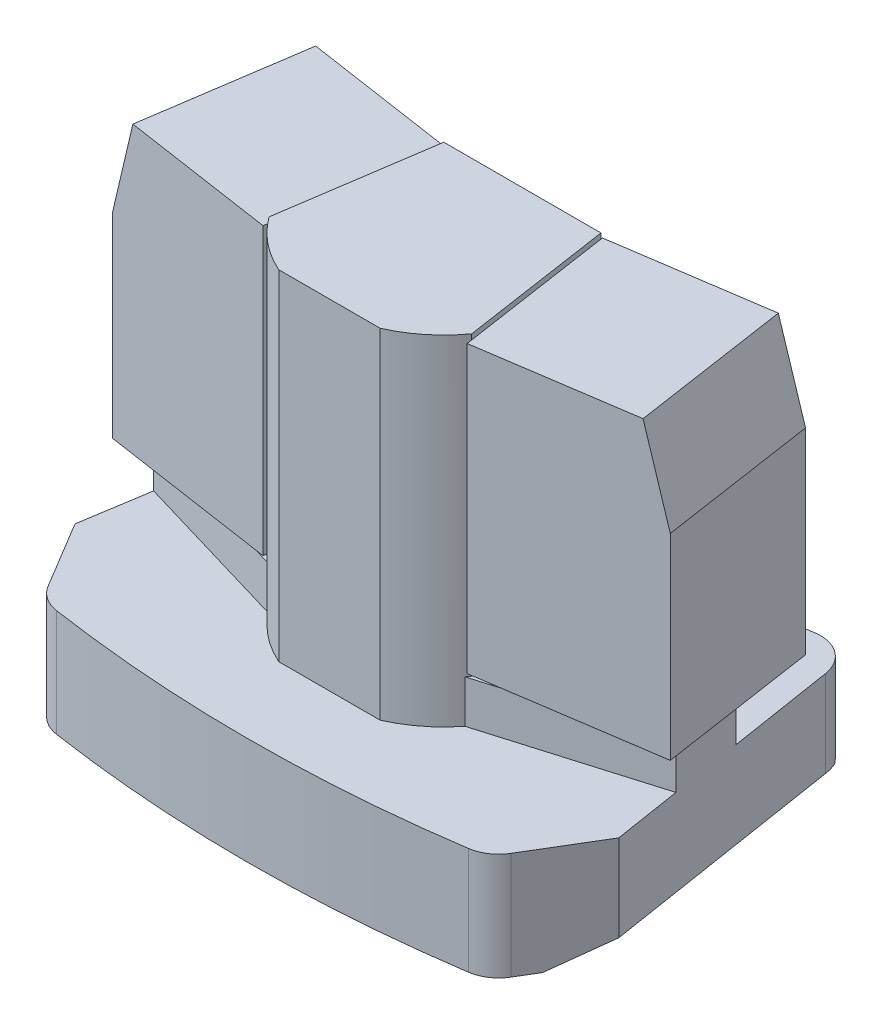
ISO-10303-21;
HEADER;
FILE_DESCRIPTION(('STEP AP214'),'2;1');
FILE_NAME('part.step','',(''),(''),'','','');
FILE_SCHEMA(('AUTOMOTIVE_DESIGN { 1 0 10303 214 1 1 1 1 }'));
ENDSEC;
DATA;
#1=APPLICATION_CONTEXT('core data for automotive mechanical design processes');
#2=APPLICATION_PROTOCOL_DEFINITION('international standard','automotive_design',2000,#1);
#3=PRODUCT_CONTEXT('',#1,'mechanical');
#4=PRODUCT('Part','Part','',(#3));
#5=PRODUCT_RELATED_PRODUCT_CATEGORY('part','',(#4));
#6=PRODUCT_DEFINITION_FORMATION('','',#4);
#7=PRODUCT_DEFINITION_CONTEXT('part definition',#1,'design');
#8=PRODUCT_DEFINITION('design','',#6,#7);
#9=PRODUCT_DEFINITION_SHAPE('','',#8);
#10=(LENGTH_UNIT() NAMED_UNIT(*) SI_UNIT(.MILLI.,.METRE.));
#11=(NAMED_UNIT(*) PLANE_ANGLE_UNIT() SI_UNIT($,.RADIAN.));
#12=(NAMED_UNIT(*) SI_UNIT($,.STERADIAN.) SOLID_ANGLE_UNIT());
#13=UNCERTAINTY_MEASURE_WITH_UNIT(LENGTH_MEASURE(1.E-05),#10,'distance_accuracy_value','');
#14=(GEOMETRIC_REPRESENTATION_CONTEXT(3) GLOBAL_UNCERTAINTY_ASSIGNED_CONTEXT((#13)) GLOBAL_UNIT_ASSIGNED_CONTEXT((#10,
#11,#12)) REPRESENTATION_CONTEXT('',''));
#15=CARTESIAN_POINT('',(0.,0.,0.));
#16=DIRECTION('',(0.,0.,1.));
#17=DIRECTION('',(1.,0.,0.));
#18=AXIS2_PLACEMENT_3D('',#15,#16,#17);
#19=CARTESIAN_POINT('',(-17.6559337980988,12.,-50.9981153));
#20=DIRECTION('',(0.989015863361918,0.,0.147809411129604));
#21=DIRECTION('',(0.147809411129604,0.,-0.989015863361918));
#22=AXIS2_PLACEMENT_3D('',#19,#20,#21);
#23=PLANE('',#22);
#24=DIRECTION('',(0.147809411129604,0.,-0.989015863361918));
#25=VECTOR('',#24,1.);
#26=CARTESIAN_POINT('',(-28.5684412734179,93.5,22.0191771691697));
#27=LINE('',#26,#25);
#28=CARTESIAN_POINT('',(-28.345972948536,93.5,20.5306068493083));
#29=VERTEX_POINT('',#28);
#30=CARTESIAN_POINT('',(-21.989731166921,93.5,-22.));
#31=VERTEX_POINT('',#30);
#32=EDGE_CURVE('E385',#29,#31,#27,.T.);
#33=ORIENTED_EDGE('',*,*,#32,.F.);
#34=DIRECTION('',(0.,1.,0.));
#35=VECTOR('',#34,1.);
#36=CARTESIAN_POINT('',(-28.345972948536,12.,20.5306068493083));
#37=LINE('',#36,#35);
#38=CARTESIAN_POINT('',(-28.345972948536,95.,20.5306068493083));
#39=VERTEX_POINT('',#38);
#40=EDGE_CURVE('E533',#29,#39,#37,.T.);
#41=ORIENTED_EDGE('',*,*,#40,.T.);
#42=DIRECTION('',(0.147809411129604,0.,-0.989015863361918));
#43=VECTOR('',#42,1.);
#44=CARTESIAN_POINT('',(-17.6559337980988,95.,-50.9981153));
#45=LINE('',#44,#43);
#46=CARTESIAN_POINT('',(-21.989731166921,95.,-22.));
#47=VERTEX_POINT('',#46);
#48=EDGE_CURVE('E519',#39,#47,#45,.T.);
#49=ORIENTED_EDGE('',*,*,#48,.T.);
#50=DIRECTION('',(0.,-1.,0.));
#51=VECTOR('',#50,1.);
#52=CARTESIAN_POINT('',(-21.989731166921,12.,-22.));
#53=LINE('',#52,#51);
#54=EDGE_CURVE('E560',#47,#31,#53,.T.);
#55=ORIENTED_EDGE('',*,*,#54,.T.);
#56=EDGE_LOOP('',(#33,#41,#49,#55));
#57=FACE_BOUND('',#56,.T.);
#58=ADVANCED_FACE('F16',(#57),#23,.F.);
#59=DIRECTION('',(-0.147809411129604,0.,0.989015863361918));
#60=VECTOR('',#59,1.);
#61=CARTESIAN_POINT('',(-28.5684412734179,13.5,22.0191771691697));
#62=LINE('',#61,#60);
#63=CARTESIAN_POINT('',(-21.989731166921,13.5,-22.));
#64=VERTEX_POINT('',#63);
#65=CARTESIAN_POINT('',(-28.345972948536,13.5,20.5306068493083));
#66=VERTEX_POINT('',#65);
#67=EDGE_CURVE('E390',#64,#66,#62,.T.);
#68=ORIENTED_EDGE('',*,*,#67,.F.);
#69=CARTESIAN_POINT('',(-21.989731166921,12.,-22.));
#70=VERTEX_POINT('',#69);
#71=EDGE_CURVE('E565',#64,#70,#53,.T.);
#72=ORIENTED_EDGE('',*,*,#71,.T.);
#73=DIRECTION('',(0.147809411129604,0.,-0.989015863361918));
#74=VECTOR('',#73,1.);
#75=CARTESIAN_POINT('',(-17.6559337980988,12.,-50.9981153));
#76=LINE('',#75,#74);
#77=CARTESIAN_POINT('',(-28.345972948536,12.,20.5306068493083));
#78=VERTEX_POINT('',#77);
#79=EDGE_CURVE('E523',#78,#70,#76,.T.);
#80=ORIENTED_EDGE('',*,*,#79,.F.);
#81=EDGE_CURVE('E529',#78,#66,#37,.T.);
#82=ORIENTED_EDGE('',*,*,#81,.T.);
#83=EDGE_LOOP('',(#68,#72,#80,#82));
#84=FACE_BOUND('',#83,.T.);
#85=ADVANCED_FACE('F674',(#84),#23,.F.);
#86=CARTESIAN_POINT('',(17.6559337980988,12.,-50.9981153));
#87=DIRECTION('',(-0.989015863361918,0.,0.147809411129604));
#88=DIRECTION('',(0.147809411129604,0.,0.989015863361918));
#89=AXIS2_PLACEMENT_3D('',#86,#87,#88);
#90=PLANE('',#89);
#91=DIRECTION('',(-0.147809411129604,0.,-0.989015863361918));
#92=VECTOR('',#91,1.);
#93=CARTESIAN_POINT('',(28.5684412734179,13.5,22.0191771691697));
#94=LINE('',#93,#92);
#95=CARTESIAN_POINT('',(28.3459729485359,13.5,20.5306068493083));
#96=VERTEX_POINT('',#95);
#97=CARTESIAN_POINT('',(21.989731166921,13.5,-22.));
#98=VERTEX_POINT('',#97);
#99=EDGE_CURVE('E419',#96,#98,#94,.T.);
#100=ORIENTED_EDGE('',*,*,#99,.F.);
#101=DIRECTION('',(0.,1.,0.));
#102=VECTOR('',#101,1.);
#103=CARTESIAN_POINT('',(28.3459729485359,12.,20.5306068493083));
#104=LINE('',#103,#102);
#105=CARTESIAN_POINT('',(28.345972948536,12.,20.5306068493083));
#106=VERTEX_POINT('',#105);
#107=EDGE_CURVE('E534',#106,#96,#104,.T.);
#108=ORIENTED_EDGE('',*,*,#107,.F.);
#109=DIRECTION('',(0.147809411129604,0.,0.989015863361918));
#110=VECTOR('',#109,1.);
#111=CARTESIAN_POINT('',(17.6559337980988,12.,-50.9981153));
#112=LINE('',#111,#110);
#113=CARTESIAN_POINT('',(21.989731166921,12.,-22.));
#114=VERTEX_POINT('',#113);
#115=EDGE_CURVE('E520',#114,#106,#112,.T.);
#116=ORIENTED_EDGE('',*,*,#115,.F.);
#117=DIRECTION('',(0.,1.,0.));
#118=VECTOR('',#117,1.);
#119=CARTESIAN_POINT('',(21.989731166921,12.,-22.));
#120=LINE('',#119,#118);
#121=EDGE_CURVE('E512',#114,#98,#120,.T.);
#122=ORIENTED_EDGE('',*,*,#121,.T.);
#123=EDGE_LOOP('',(#100,#108,#116,#122));
#124=FACE_BOUND('',#123,.T.);
#125=ADVANCED_FACE('F681',(#124),#90,.F.);
#126=DIRECTION('',(0.147809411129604,0.,0.989015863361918));
#127=VECTOR('',#126,1.);
#128=CARTESIAN_POINT('',(28.5684412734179,93.5,22.0191771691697));
#129=LINE('',#128,#127);
#130=CARTESIAN_POINT('',(21.989731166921,93.5,-22.));
#131=VERTEX_POINT('',#130);
#132=CARTESIAN_POINT('',(28.3459729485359,93.5,20.5306068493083));
#133=VERTEX_POINT('',#132);
#134=EDGE_CURVE('E425',#131,#133,#129,.T.);
#135=ORIENTED_EDGE('',*,*,#134,.F.);
#136=CARTESIAN_POINT('',(21.989731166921,95.,-22.));
#137=VERTEX_POINT('',#136);
#138=EDGE_CURVE('E511',#131,#137,#120,.T.);
#139=ORIENTED_EDGE('',*,*,#138,.T.);
#140=DIRECTION('',(0.147809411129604,0.,0.989015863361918));
#141=VECTOR('',#140,1.);
#142=CARTESIAN_POINT('',(24.7253965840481,95.,-3.69523527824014));
#143=LINE('',#142,#141);
#144=CARTESIAN_POINT('',(28.3459729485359,95.,20.5306068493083));
#145=VERTEX_POINT('',#144);
#146=EDGE_CURVE('E554',#137,#145,#143,.T.);
#147=ORIENTED_EDGE('',*,*,#146,.T.);
#148=EDGE_CURVE('E526',#133,#145,#104,.T.);
#149=ORIENTED_EDGE('',*,*,#148,.F.);
#150=EDGE_LOOP('',(#135,#139,#147,#149));
#151=FACE_BOUND('',#150,.T.);
#152=ADVANCED_FACE('F689',(#151),#90,.F.);
#153=CARTESIAN_POINT('',(0.,95.,0.));
#154=DIRECTION('',(0.,-1.,0.));
#155=DIRECTION('',(0.,0.,-1.));
#156=AXIS2_PLACEMENT_3D('',#153,#154,#155);
#157=CYLINDRICAL_SURFACE('',#156,35.);
#158=CARTESIAN_POINT('',(0.,95.,0.));
#159=DIRECTION('',(0.,1.,0.));
#160=DIRECTION('',(0.,0.,1.));
#161=AXIS2_PLACEMENT_3D('',#158,#159,#160);
#162=CIRCLE('',#161,35.);
#163=CARTESIAN_POINT('',(14.1774468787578,95.,32.));
#164=VERTEX_POINT('',#163);
#165=EDGE_CURVE('E548',#164,#145,#162,.T.);
#166=ORIENTED_EDGE('',*,*,#165,.F.);
#167=DIRECTION('',(0.,-1.,0.));
#168=VECTOR('',#167,1.);
#169=CARTESIAN_POINT('',(14.1774468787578,95.,32.));
#170=LINE('',#169,#168);
#171=CARTESIAN_POINT('',(14.1774468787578,0.,32.));
#172=VERTEX_POINT('',#171);
#173=EDGE_CURVE('E443',#164,#172,#170,.T.);
#174=ORIENTED_EDGE('',*,*,#173,.T.);
#175=CARTESIAN_POINT('',(0.,0.,0.));
#176=DIRECTION('',(0.,1.,0.));
#177=DIRECTION('',(0.,0.,1.));
#178=AXIS2_PLACEMENT_3D('',#175,#176,#177);
#179=CIRCLE('',#178,35.);
#180=CARTESIAN_POINT('',(27.529910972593,0.,21.6125889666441));
#181=VERTEX_POINT('',#180);
#182=EDGE_CURVE('E550',#172,#181,#179,.T.);
#183=ORIENTED_EDGE('',*,*,#182,.T.);
#184=DIRECTION('',(0.,-1.,0.));
#185=VECTOR('',#184,1.);
#186=CARTESIAN_POINT('',(27.529910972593,97.1197894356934,21.6125889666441));
#187=LINE('',#186,#185);
#188=CARTESIAN_POINT('',(27.529910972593,12.,21.6125889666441));
#189=VERTEX_POINT('',#188);
#190=EDGE_CURVE('E475',#189,#181,#187,.T.);
#191=ORIENTED_EDGE('',*,*,#190,.F.);
#192=CARTESIAN_POINT('',(0.,12.,0.));
#193=DIRECTION('',(0.,-1.,0.));
#194=DIRECTION('',(0.,0.,-1.));
#195=AXIS2_PLACEMENT_3D('',#192,#193,#194);
#196=CIRCLE('',#195,35.);
#197=EDGE_CURVE('E462',#189,#106,#196,.F.);
#198=ORIENTED_EDGE('',*,*,#197,.T.);
#199=ORIENTED_EDGE('',*,*,#107,.T.);
#200=DIRECTION('',(0.,-1.,0.));
#201=VECTOR('',#200,1.);
#202=CARTESIAN_POINT('',(28.345972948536,95.,20.5306068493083));
#203=LINE('',#202,#201);
#204=EDGE_CURVE('E435',#133,#96,#203,.T.);
#205=ORIENTED_EDGE('',*,*,#204,.F.);
#206=ORIENTED_EDGE('',*,*,#148,.T.);
#207=EDGE_LOOP('',(#166,#174,#183,#191,#198,#199,#205,#206));
#208=FACE_BOUND('',#207,.T.);
#209=ADVANCED_FACE('F695',(#208),#157,.T.);
#210=CARTESIAN_POINT('',(0.,-30.,-335.));
#211=DIRECTION('',(0.,1.,0.));
#212=DIRECTION('',(0.,0.,1.));
#213=AXIS2_PLACEMENT_3D('',#210,#211,#212);
#214=PLANE('',#213);
#215=CARTESIAN_POINT('',(0.,-30.,-335.));
#216=DIRECTION('',(0.,1.,0.));
#217=DIRECTION('',(0.,0.,1.));
#218=AXIS2_PLACEMENT_3D('',#215,#216,#217);
#219=CIRCLE('',#218,315.);
#220=CARTESIAN_POINT('',(-57.6642187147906,-30.,-25.3230104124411));
#221=VERTEX_POINT('',#220);
#222=CARTESIAN_POINT('',(57.6642187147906,-30.,-25.3230104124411));
#223=VERTEX_POINT('',#222);
#224=EDGE_CURVE('E611',#221,#223,#219,.T.);
#225=ORIENTED_EDGE('',*,*,#224,.T.);
#226=DIRECTION('',(0.156434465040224,0.,0.987688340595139));
#227=VECTOR('',#226,1.);
#228=CARTESIAN_POINT('',(66.2173461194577,-30.,28.6793106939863));
#229=LINE('',#228,#227);
#230=CARTESIAN_POINT('',(68.0816594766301,-30.,40.4501219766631));
#231=VERTEX_POINT('',#230);
#232=EDGE_CURVE('E894',#223,#231,#229,.T.);
#233=ORIENTED_EDGE('',*,*,#232,.T.);
#234=DIRECTION('',(0.51503807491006,0.,-0.857167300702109));
#235=VECTOR('',#234,1.);
#236=CARTESIAN_POINT('',(62.3536400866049,-30.,49.9831471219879));
#237=LINE('',#236,#235);
#238=CARTESIAN_POINT('',(64.7632907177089,-30.,45.9728150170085));
#239=VERTEX_POINT('',#238);
#240=EDGE_CURVE('E585',#231,#239,#237,.F.);
#241=ORIENTED_EDGE('',*,*,#240,.T.);
#242=CARTESIAN_POINT('',(56.1916177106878,-30.,40.822434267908));
#243=DIRECTION('',(0.,1.,0.));
#244=DIRECTION('',(0.,0.,1.));
#245=AXIS2_PLACEMENT_3D('',#242,#243,#244);
#246=CIRCLE('',#245,10.);
#247=CARTESIAN_POINT('',(57.670344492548,-30.,50.7124983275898));
#248=VERTEX_POINT('',#247);
#249=EDGE_CURVE('E869',#239,#248,#246,.F.);
#250=ORIENTED_EDGE('',*,*,#249,.T.);
#251=CARTESIAN_POINT('',(0.,-30.,-335.));
#252=DIRECTION('',(0.,1.,0.));
#253=DIRECTION('',(0.,0.,1.));
#254=AXIS2_PLACEMENT_3D('',#251,#252,#253);
#255=CIRCLE('',#254,390.);
#256=CARTESIAN_POINT('',(-57.670344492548,-30.,50.7124983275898));
#257=VERTEX_POINT('',#256);
#258=EDGE_CURVE('E537',#257,#248,#255,.T.);
#259=ORIENTED_EDGE('',*,*,#258,.F.);
#260=CARTESIAN_POINT('',(-56.1916177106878,-30.,40.822434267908));
#261=DIRECTION('',(0.,1.,0.));
#262=DIRECTION('',(0.,0.,1.));
#263=AXIS2_PLACEMENT_3D('',#260,#261,#262);
#264=CIRCLE('',#263,10.);
#265=CARTESIAN_POINT('',(-64.7632907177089,-30.,45.9728150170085));
#266=VERTEX_POINT('',#265);
#267=EDGE_CURVE('E865',#257,#266,#264,.F.);
#268=ORIENTED_EDGE('',*,*,#267,.T.);
#269=DIRECTION('',(-0.51503807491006,0.,-0.857167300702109));
#270=VECTOR('',#269,1.);
#271=CARTESIAN_POINT('',(-62.3536400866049,-30.,49.9831471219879));
#272=LINE('',#271,#270);
#273=CARTESIAN_POINT('',(-68.0816594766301,-30.,40.4501219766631));
#274=VERTEX_POINT('',#273);
#275=EDGE_CURVE('E587',#266,#274,#272,.T.);
#276=ORIENTED_EDGE('',*,*,#275,.T.);
#277=DIRECTION('',(0.156434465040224,0.,-0.987688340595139));
#278=VECTOR('',#277,1.);
#279=CARTESIAN_POINT('',(-57.597054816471,-30.,-25.7470665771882));
#280=LINE('',#279,#278);
#281=EDGE_CURVE('E895',#274,#221,#280,.T.);
#282=ORIENTED_EDGE('',*,*,#281,.T.);
#283=EDGE_LOOP('',(#225,#233,#241,#250,#259,#268,#276,#282));
#284=FACE_BOUND('',#283,.T.);
#285=DIRECTION('',(0.156434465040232,0.,-0.987688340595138));
#286=VECTOR('',#285,1.);
#287=CARTESIAN_POINT('',(0.,-30.,-335.));
#288=LINE('',#287,#286);
#289=CARTESIAN_POINT('',(-56.6076652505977,-30.,22.4067322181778));
#290=VERTEX_POINT('',#289);
#291=CARTESIAN_POINT('',(-51.1301448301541,-30.,-12.1769706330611));
#292=VERTEX_POINT('',#291);
#293=EDGE_CURVE('E809',#290,#292,#288,.T.);
#294=ORIENTED_EDGE('',*,*,#293,.F.);
#295=CARTESIAN_POINT('',(-46.7307818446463,-30.,23.9710768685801));
#296=DIRECTION('',(0.,1.,0.));
#297=DIRECTION('',(0.,0.,1.));
#298=AXIS2_PLACEMENT_3D('',#295,#296,#297);
#299=CIRCLE('',#298,10.);
#300=CARTESIAN_POINT('',(-48.0216874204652,-30.,33.8874049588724));
#301=VERTEX_POINT('',#300);
#302=EDGE_CURVE('E24',#290,#301,#299,.T.);
#303=ORIENTED_EDGE('',*,*,#302,.T.);
#304=CARTESIAN_POINT('',(0.,-30.,-335.));
#305=DIRECTION('',(0.,1.,0.));
#306=DIRECTION('',(0.,0.,1.));
#307=AXIS2_PLACEMENT_3D('',#304,#305,#306);
#308=CIRCLE('',#307,372.);
#309=CARTESIAN_POINT('',(48.0216874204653,-30.,33.8874049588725));
#310=VERTEX_POINT('',#309);
#311=EDGE_CURVE('E808',#301,#310,#308,.T.);
#312=ORIENTED_EDGE('',*,*,#311,.T.);
#313=CARTESIAN_POINT('',(46.7307818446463,-30.,23.9710768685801));
#314=DIRECTION('',(0.,1.,0.));
#315=DIRECTION('',(0.,0.,1.));
#316=AXIS2_PLACEMENT_3D('',#313,#314,#315);
#317=CIRCLE('',#316,10.);
#318=CARTESIAN_POINT('',(56.6076652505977,-30.,22.4067322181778));
#319=VERTEX_POINT('',#318);
#320=EDGE_CURVE('E796',#310,#319,#317,.T.);
#321=ORIENTED_EDGE('',*,*,#320,.T.);
#322=DIRECTION('',(-0.156434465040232,0.,-0.987688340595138));
#323=VECTOR('',#322,1.);
#324=CARTESIAN_POINT('',(0.,-30.,-335.));
#325=LINE('',#324,#323);
#326=CARTESIAN_POINT('',(51.1301448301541,-30.,-12.1769706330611));
#327=VERTEX_POINT('',#326);
#328=EDGE_CURVE('E907',#319,#327,#325,.T.);
#329=ORIENTED_EDGE('',*,*,#328,.T.);
#330=CARTESIAN_POINT('',(41.2532614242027,-30.,-10.6126259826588));
#331=DIRECTION('',(0.,1.,0.));
#332=DIRECTION('',(0.,0.,1.));
#333=AXIS2_PLACEMENT_3D('',#330,#331,#332);
#334=CIRCLE('',#333,10.);
#335=CARTESIAN_POINT('',(39.9916937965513,-30.,-20.5327291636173));
#336=VERTEX_POINT('',#335);
#337=EDGE_CURVE('E799',#327,#336,#334,.T.);
#338=ORIENTED_EDGE('',*,*,#337,.T.);
#339=CARTESIAN_POINT('',(0.,-30.,-335.));
#340=DIRECTION('',(0.,1.,0.));
#341=DIRECTION('',(0.,0.,1.));
#342=AXIS2_PLACEMENT_3D('',#339,#340,#341);
#343=CIRCLE('',#342,317.);
#344=CARTESIAN_POINT('',(-39.9916937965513,-30.,-20.5327291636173));
#345=VERTEX_POINT('',#344);
#346=EDGE_CURVE('E811',#336,#345,#343,.F.);
#347=ORIENTED_EDGE('',*,*,#346,.T.);
#348=CARTESIAN_POINT('',(-41.2532614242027,-30.,-10.6126259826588));
#349=DIRECTION('',(0.,1.,0.));
#350=DIRECTION('',(0.,0.,1.));
#351=AXIS2_PLACEMENT_3D('',#348,#349,#350);
#352=CIRCLE('',#351,10.);
#353=EDGE_CURVE('E11',#345,#292,#352,.T.);
#354=ORIENTED_EDGE('',*,*,#353,.T.);
#355=EDGE_LOOP('',(#294,#303,#312,#321,#329,#338,#347,#354));
#356=FACE_BOUND('',#355,.T.);
#357=ADVANCED_FACE('F691',(#284,#356),#214,.F.);
#358=CARTESIAN_POINT('',(0.,0.,-335.));
#359=DIRECTION('',(0.,1.,0.));
#360=DIRECTION('',(0.,0.,1.));
#361=AXIS2_PLACEMENT_3D('',#358,#359,#360);
#362=PLANE('',#361);
#363=CARTESIAN_POINT('',(0.,0.,-335.));
#364=DIRECTION('',(0.,-1.,0.));
#365=DIRECTION('',(0.,0.,1.));
#366=AXIS2_PLACEMENT_3D('',#363,#364,#365);
#367=CIRCLE('',#366,290.);
#368=CARTESIAN_POINT('',(53.4729086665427,0.,-49.9725486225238));
#369=VERTEX_POINT('',#368);
#370=CARTESIAN_POINT('',(-53.4729086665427,0.,-49.9725486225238));
#371=VERTEX_POINT('',#370);
#372=EDGE_CURVE('E541',#369,#371,#367,.T.);
#373=ORIENTED_EDGE('',*,*,#372,.T.);
#374=CARTESIAN_POINT('',(-55.3168020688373,0.,-40.1440158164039));
#375=DIRECTION('',(0.,1.,0.));
#376=DIRECTION('',(0.,0.,1.));
#377=AXIS2_PLACEMENT_3D('',#374,#375,#376);
#378=CIRCLE('',#377,10.);
#379=CARTESIAN_POINT('',(-65.1936854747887,0.,-41.708360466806));
#380=VERTEX_POINT('',#379);
#381=EDGE_CURVE('E578',#371,#380,#378,.T.);
#382=ORIENTED_EDGE('',*,*,#381,.T.);
#383=DIRECTION('',(-0.156434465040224,0.,0.987688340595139));
#384=VECTOR('',#383,1.);
#385=CARTESIAN_POINT('',(-18.2822319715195,0.,-337.895621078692));
#386=LINE('',#385,#384);
#387=CARTESIAN_POINT('',(-69.9297851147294,0.,-11.8058041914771));
#388=VERTEX_POINT('',#387);
#389=EDGE_CURVE('E455',#380,#388,#386,.T.);
#390=ORIENTED_EDGE('',*,*,#389,.T.);
#391=DIRECTION('',(-0.958819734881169,0.,-0.284015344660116));
#392=VECTOR('',#391,1.);
#393=CARTESIAN_POINT('',(-34.9699419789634,0.,-1.45022687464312));
#394=LINE('',#393,#392);
#395=CARTESIAN_POINT('',(-34.9699419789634,0.,-1.45022687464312));
#396=VERTEX_POINT('',#395);
#397=EDGE_CURVE('E466',#396,#388,#394,.T.);
#398=ORIENTED_EDGE('',*,*,#397,.F.);
#399=CARTESIAN_POINT('',(-27.2213151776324,0.,-22.));
#400=VERTEX_POINT('',#399);
#401=EDGE_CURVE('E545',#400,#396,#179,.T.);
#402=ORIENTED_EDGE('',*,*,#401,.F.);
#403=DIRECTION('',(-1.,0.,0.));
#404=VECTOR('',#403,1.);
#405=CARTESIAN_POINT('',(-33.68459531,0.,-22.));
#406=LINE('',#405,#404);
#407=CARTESIAN_POINT('',(27.2213151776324,0.,-22.));
#408=VERTEX_POINT('',#407);
#409=EDGE_CURVE('E500',#408,#400,#406,.T.);
#410=ORIENTED_EDGE('',*,*,#409,.F.);
#411=CARTESIAN_POINT('',(34.9699419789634,0.,-1.45022687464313));
#412=VERTEX_POINT('',#411);
#413=EDGE_CURVE('E540',#412,#408,#179,.T.);
#414=ORIENTED_EDGE('',*,*,#413,.F.);
#415=DIRECTION('',(-0.958819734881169,0.,0.284015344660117));
#416=VECTOR('',#415,1.);
#417=CARTESIAN_POINT('',(34.9699419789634,0.,-1.45022687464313));
#418=LINE('',#417,#416);
#419=CARTESIAN_POINT('',(69.9297851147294,0.,-11.8058041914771));
#420=VERTEX_POINT('',#419);
#421=EDGE_CURVE('E470',#420,#412,#418,.T.);
#422=ORIENTED_EDGE('',*,*,#421,.F.);
#423=DIRECTION('',(-0.156434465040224,0.,-0.987688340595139));
#424=VECTOR('',#423,1.);
#425=CARTESIAN_POINT('',(18.2822319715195,0.,-337.895621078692));
#426=LINE('',#425,#424);
#427=CARTESIAN_POINT('',(65.1936854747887,0.,-41.708360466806));
#428=VERTEX_POINT('',#427);
#429=EDGE_CURVE('E451',#420,#428,#426,.T.);
#430=ORIENTED_EDGE('',*,*,#429,.T.);
#431=CARTESIAN_POINT('',(55.3168020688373,0.,-40.1440158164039));
#432=DIRECTION('',(0.,1.,0.));
#433=DIRECTION('',(0.,0.,1.));
#434=AXIS2_PLACEMENT_3D('',#431,#432,#433);
#435=CIRCLE('',#434,10.);
#436=EDGE_CURVE('E576',#428,#369,#435,.T.);
#437=ORIENTED_EDGE('',*,*,#436,.T.);
#438=EDGE_LOOP('',(#373,#382,#390,#398,#402,#410,#414,#422,#430,#437));
#439=FACE_BOUND('',#438,.T.);
#440=ADVANCED_FACE('F694',(#439),#362,.T.);
#441=ORIENTED_EDGE('',*,*,#182,.F.);
#442=DIRECTION('',(1.,0.,0.));
#443=VECTOR('',#442,1.);
#444=CARTESIAN_POINT('',(-25.,0.,32.));
#445=LINE('',#444,#443);
#446=CARTESIAN_POINT('',(-14.1774468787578,0.,32.));
#447=VERTEX_POINT('',#446);
#448=EDGE_CURVE('E438',#447,#172,#445,.T.);
#449=ORIENTED_EDGE('',*,*,#448,.F.);
#450=CARTESIAN_POINT('',(-27.529910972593,0.,21.6125889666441));
#451=VERTEX_POINT('',#450);
#452=EDGE_CURVE('E549',#451,#447,#179,.T.);
#453=ORIENTED_EDGE('',*,*,#452,.F.);
#454=DIRECTION('',(0.958819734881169,0.,0.284015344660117));
#455=VECTOR('',#454,1.);
#456=CARTESIAN_POINT('',(-27.529910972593,0.,21.6125889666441));
#457=LINE('',#456,#455);
#458=CARTESIAN_POINT('',(-73.0854717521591,0.,8.11841709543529));
#459=VERTEX_POINT('',#458);
#460=EDGE_CURVE('E488',#459,#451,#457,.T.);
#461=ORIENTED_EDGE('',*,*,#460,.F.);
#462=CARTESIAN_POINT('',(-76.0942295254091,0.,27.1149660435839));
#463=VERTEX_POINT('',#462);
#464=EDGE_CURVE('E458',#459,#463,#386,.T.);
#465=ORIENTED_EDGE('',*,*,#464,.T.);
#466=DIRECTION('',(0.51503807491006,0.,0.857167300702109));
#467=VECTOR('',#466,1.);
#468=CARTESIAN_POINT('',(-215.773421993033,0.,-205.350248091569));
#469=LINE('',#468,#467);
#470=CARTESIAN_POINT('',(-64.7632907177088,0.,45.9728150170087));
#471=VERTEX_POINT('',#470);
#472=EDGE_CURVE('E594',#463,#471,#469,.T.);
#473=ORIENTED_EDGE('',*,*,#472,.T.);
#474=CARTESIAN_POINT('',(-56.1916177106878,0.,40.822434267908));
#475=DIRECTION('',(0.,1.,0.));
#476=DIRECTION('',(0.,0.,1.));
#477=AXIS2_PLACEMENT_3D('',#474,#475,#476);
#478=CIRCLE('',#477,10.);
#479=CARTESIAN_POINT('',(-57.670344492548,0.,50.7124983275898));
#480=VERTEX_POINT('',#479);
#481=EDGE_CURVE('E867',#471,#480,#478,.T.);
#482=ORIENTED_EDGE('',*,*,#481,.T.);
#483=CARTESIAN_POINT('',(0.,0.,-335.));
#484=DIRECTION('',(0.,1.,0.));
#485=DIRECTION('',(0.,0.,1.));
#486=AXIS2_PLACEMENT_3D('',#483,#484,#485);
#487=CIRCLE('',#486,390.);
#488=CARTESIAN_POINT('',(57.670344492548,0.,50.7124983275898));
#489=VERTEX_POINT('',#488);
#490=EDGE_CURVE('E532',#480,#489,#487,.T.);
#491=ORIENTED_EDGE('',*,*,#490,.T.);
#492=CARTESIAN_POINT('',(56.1916177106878,0.,40.822434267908));
#493=DIRECTION('',(0.,1.,0.));
#494=DIRECTION('',(0.,0.,1.));
#495=AXIS2_PLACEMENT_3D('',#492,#493,#494);
#496=CIRCLE('',#495,10.);
#497=CARTESIAN_POINT('',(64.7632907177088,0.,45.9728150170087));
#498=VERTEX_POINT('',#497);
#499=EDGE_CURVE('E864',#489,#498,#496,.T.);
#500=ORIENTED_EDGE('',*,*,#499,.T.);
#501=DIRECTION('',(-0.51503807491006,0.,0.857167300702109));
#502=VECTOR('',#501,1.);
#503=CARTESIAN_POINT('',(215.773421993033,0.,-205.350248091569));
#504=LINE('',#503,#502);
#505=CARTESIAN_POINT('',(76.0942295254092,0.,27.1149660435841));
#506=VERTEX_POINT('',#505);
#507=EDGE_CURVE('E592',#498,#506,#504,.F.);
#508=ORIENTED_EDGE('',*,*,#507,.T.);
#509=CARTESIAN_POINT('',(73.0854717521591,0.,8.11841709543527));
#510=VERTEX_POINT('',#509);
#511=EDGE_CURVE('E448',#506,#510,#426,.T.);
#512=ORIENTED_EDGE('',*,*,#511,.T.);
#513=DIRECTION('',(0.958819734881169,0.,-0.284015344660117));
#514=VECTOR('',#513,1.);
#515=CARTESIAN_POINT('',(27.529910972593,0.,21.6125889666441));
#516=LINE('',#515,#514);
#517=EDGE_CURVE('E467',#181,#510,#516,.T.);
#518=ORIENTED_EDGE('',*,*,#517,.F.);
#519=EDGE_LOOP('',(#441,#449,#453,#461,#465,#473,#482,#491,#500,#508,#512,#518));
#520=FACE_BOUND('',#519,.T.);
#521=ADVANCED_FACE('F699',(#520),#362,.T.);
#522=CARTESIAN_POINT('',(0.,-30.,-335.));
#523=DIRECTION('',(0.,1.,0.));
#524=DIRECTION('',(0.,0.,1.));
#525=AXIS2_PLACEMENT_3D('',#522,#523,#524);
#526=CYLINDRICAL_SURFACE('',#525,390.);
#527=ORIENTED_EDGE('',*,*,#490,.F.);
#528=DIRECTION('',(0.,1.,0.));
#529=VECTOR('',#528,1.);
#530=CARTESIAN_POINT('',(-57.670344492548,-30.,50.7124983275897));
#531=LINE('',#530,#529);
#532=EDGE_CURVE('E1274',#480,#257,#531,.F.);
#533=ORIENTED_EDGE('',*,*,#532,.T.);
#534=ORIENTED_EDGE('',*,*,#258,.T.);
#535=DIRECTION('',(0.,1.,0.));
#536=VECTOR('',#535,1.);
#537=CARTESIAN_POINT('',(57.670344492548,-30.,50.7124983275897));
#538=LINE('',#537,#536);
#539=EDGE_CURVE('E891',#248,#489,#538,.T.);
#540=ORIENTED_EDGE('',*,*,#539,.T.);
#541=EDGE_LOOP('',(#527,#533,#534,#540));
#542=FACE_BOUND('',#541,.T.);
#543=ADVANCED_FACE('F704',(#542),#526,.T.);
#544=CARTESIAN_POINT('',(0.,-30.,-335.));
#545=DIRECTION('',(0.,1.,0.));
#546=DIRECTION('',(0.,0.,1.));
#547=AXIS2_PLACEMENT_3D('',#544,#545,#546);
#548=CYLINDRICAL_SURFACE('',#547,290.);
#549=DIRECTION('',(0.,1.,0.));
#550=VECTOR('',#549,1.);
#551=CARTESIAN_POINT('',(53.4729086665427,-30.,-49.9725486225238));
#552=LINE('',#551,#550);
#553=CARTESIAN_POINT('',(53.4729086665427,-23.3012701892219,-49.9725486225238));
#554=VERTEX_POINT('',#553);
#555=EDGE_CURVE('E571',#369,#554,#552,.F.);
#556=ORIENTED_EDGE('',*,*,#555,.T.);
#557=CARTESIAN_POINT('',(0.,-23.3012701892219,-335.));
#558=DIRECTION('',(0.,1.,0.));
#559=DIRECTION('',(0.,0.,1.));
#560=AXIS2_PLACEMENT_3D('',#557,#558,#559);
#561=CIRCLE('',#560,290.);
#562=CARTESIAN_POINT('',(-53.4729086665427,-23.3012701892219,-49.9725486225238));
#563=VERTEX_POINT('',#562);
#564=EDGE_CURVE('E600',#554,#563,#561,.F.);
#565=ORIENTED_EDGE('',*,*,#564,.T.);
#566=DIRECTION('',(0.,1.,0.));
#567=VECTOR('',#566,1.);
#568=CARTESIAN_POINT('',(-53.4729086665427,-30.,-49.9725486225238));
#569=LINE('',#568,#567);
#570=EDGE_CURVE('E574',#563,#371,#569,.T.);
#571=ORIENTED_EDGE('',*,*,#570,.T.);
#572=ORIENTED_EDGE('',*,*,#372,.F.);
#573=EDGE_LOOP('',(#556,#565,#571,#572));
#574=FACE_BOUND('',#573,.T.);
#575=ADVANCED_FACE('F701',(#574),#548,.F.);
#576=CARTESIAN_POINT('',(0.,12.,0.));
#577=DIRECTION('',(0.,-1.,0.));
#578=DIRECTION('',(0.,0.,-1.));
#579=AXIS2_PLACEMENT_3D('',#576,#577,#578);
#580=PLANE('',#579);
#581=DIRECTION('',(0.156434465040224,0.,0.987688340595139));
#582=VECTOR('',#581,1.);
#583=CARTESIAN_POINT('',(70.0425785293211,12.,-11.0936545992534));
#584=LINE('',#583,#582);
#585=CARTESIAN_POINT('',(69.9297851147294,12.,-11.8058041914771));
#586=VERTEX_POINT('',#585);
#587=CARTESIAN_POINT('',(73.0854717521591,12.,8.11841709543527));
#588=VERTEX_POINT('',#587);
#589=EDGE_CURVE('E446',#586,#588,#584,.T.);
#590=ORIENTED_EDGE('',*,*,#589,.F.);
#591=DIRECTION('',(0.958819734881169,0.,-0.284015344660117));
#592=VECTOR('',#591,1.);
#593=CARTESIAN_POINT('',(34.9699419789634,12.,-1.45022687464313));
#594=LINE('',#593,#592);
#595=CARTESIAN_POINT('',(34.9699419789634,12.,-1.45022687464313));
#596=VERTEX_POINT('',#595);
#597=EDGE_CURVE('E463',#596,#586,#594,.T.);
#598=ORIENTED_EDGE('',*,*,#597,.F.);
#599=CARTESIAN_POINT('',(0.,12.,0.));
#600=DIRECTION('',(0.,-1.,0.));
#601=DIRECTION('',(0.,0.,-1.));
#602=AXIS2_PLACEMENT_3D('',#599,#600,#601);
#603=CIRCLE('',#602,35.);
#604=CARTESIAN_POINT('',(27.2213151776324,12.,-22.));
#605=VERTEX_POINT('',#604);
#606=EDGE_CURVE('E559',#605,#596,#603,.T.);
#607=ORIENTED_EDGE('',*,*,#606,.F.);
#608=DIRECTION('',(-1.,0.,0.));
#609=VECTOR('',#608,1.);
#610=CARTESIAN_POINT('',(0.,12.,-22.));
#611=LINE('',#610,#609);
#612=EDGE_CURVE('E508',#605,#114,#611,.T.);
#613=ORIENTED_EDGE('',*,*,#612,.T.);
#614=ORIENTED_EDGE('',*,*,#115,.T.);
#615=ORIENTED_EDGE('',*,*,#197,.F.);
#616=DIRECTION('',(-0.958819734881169,0.,0.284015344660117));
#617=VECTOR('',#616,1.);
#618=CARTESIAN_POINT('',(27.529910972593,12.,21.6125889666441));
#619=LINE('',#618,#617);
#620=EDGE_CURVE('E460',#588,#189,#619,.T.);
#621=ORIENTED_EDGE('',*,*,#620,.F.);
#622=EDGE_LOOP('',(#590,#598,#607,#613,#614,#615,#621));
#623=FACE_BOUND('',#622,.T.);
#624=ADVANCED_FACE('F685',(#623),#580,.F.);
#625=DIRECTION('',(0.156434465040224,0.,-0.987688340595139));
#626=VECTOR('',#625,1.);
#627=CARTESIAN_POINT('',(-70.0425785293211,12.,-11.0936545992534));
#628=LINE('',#627,#626);
#629=CARTESIAN_POINT('',(-73.085471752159,12.,8.11841709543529));
#630=VERTEX_POINT('',#629);
#631=CARTESIAN_POINT('',(-69.9297851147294,12.,-11.8058041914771));
#632=VERTEX_POINT('',#631);
#633=EDGE_CURVE('E453',#630,#632,#628,.T.);
#634=ORIENTED_EDGE('',*,*,#633,.F.);
#635=DIRECTION('',(-0.958819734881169,0.,-0.284015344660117));
#636=VECTOR('',#635,1.);
#637=CARTESIAN_POINT('',(-27.529910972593,12.,21.6125889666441));
#638=LINE('',#637,#636);
#639=CARTESIAN_POINT('',(-27.529910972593,12.,21.6125889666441));
#640=VERTEX_POINT('',#639);
#641=EDGE_CURVE('E483',#640,#630,#638,.T.);
#642=ORIENTED_EDGE('',*,*,#641,.F.);
#643=CARTESIAN_POINT('',(0.,12.,0.));
#644=DIRECTION('',(0.,-1.,0.));
#645=DIRECTION('',(0.,0.,-1.));
#646=AXIS2_PLACEMENT_3D('',#643,#644,#645);
#647=CIRCLE('',#646,35.);
#648=EDGE_CURVE('E482',#78,#640,#647,.F.);
#649=ORIENTED_EDGE('',*,*,#648,.F.);
#650=ORIENTED_EDGE('',*,*,#79,.T.);
#651=DIRECTION('',(-1.,0.,0.));
#652=VECTOR('',#651,1.);
#653=CARTESIAN_POINT('',(0.,12.,-22.));
#654=LINE('',#653,#652);
#655=CARTESIAN_POINT('',(-27.2213151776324,12.,-22.));
#656=VERTEX_POINT('',#655);
#657=EDGE_CURVE('E502',#70,#656,#654,.T.);
#658=ORIENTED_EDGE('',*,*,#657,.T.);
#659=CARTESIAN_POINT('',(-34.9699419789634,12.,-1.45022687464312));
#660=VERTEX_POINT('',#659);
#661=EDGE_CURVE('E557',#660,#656,#603,.T.);
#662=ORIENTED_EDGE('',*,*,#661,.F.);
#663=DIRECTION('',(0.958819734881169,0.,0.284015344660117));
#664=VECTOR('',#663,1.);
#665=CARTESIAN_POINT('',(-34.9699419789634,12.,-1.45022687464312));
#666=LINE('',#665,#664);
#667=EDGE_CURVE('E480',#632,#660,#666,.T.);
#668=ORIENTED_EDGE('',*,*,#667,.F.);
#669=EDGE_LOOP('',(#634,#642,#649,#650,#658,#662,#668));
#670=FACE_BOUND('',#669,.T.);
#671=ADVANCED_FACE('F845',(#670),#580,.F.);
#672=CARTESIAN_POINT('',(-27.529910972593,97.1197894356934,21.6125889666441));
#673=DIRECTION('',(0.284015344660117,0.,-0.958819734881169));
#674=DIRECTION('',(-0.958819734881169,0.,-0.284015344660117));
#675=AXIS2_PLACEMENT_3D('',#672,#673,#674);
#676=PLANE('',#675);
#677=DIRECTION('',(0.,1.,0.));
#678=VECTOR('',#677,1.);
#679=CARTESIAN_POINT('',(-73.0854717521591,97.1197894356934,8.11841709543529));
#680=LINE('',#679,#678);
#681=EDGE_CURVE('E457',#459,#630,#680,.T.);
#682=ORIENTED_EDGE('',*,*,#681,.F.);
#683=ORIENTED_EDGE('',*,*,#460,.T.);
#684=DIRECTION('',(0.,-1.,0.));
#685=VECTOR('',#684,1.);
#686=CARTESIAN_POINT('',(-27.529910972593,97.1197894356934,21.6125889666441));
#687=LINE('',#686,#685);
#688=EDGE_CURVE('E490',#640,#451,#687,.T.);
#689=ORIENTED_EDGE('',*,*,#688,.F.);
#690=ORIENTED_EDGE('',*,*,#641,.T.);
#691=EDGE_LOOP('',(#682,#683,#689,#690));
#692=FACE_BOUND('',#691,.T.);
#693=ADVANCED_FACE('F850',(#692),#676,.F.);
#694=CARTESIAN_POINT('',(-34.9699419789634,97.1197894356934,-1.45022687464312));
#695=DIRECTION('',(-0.284015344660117,0.,0.958819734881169));
#696=DIRECTION('',(0.958819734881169,0.,0.284015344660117));
#697=AXIS2_PLACEMENT_3D('',#694,#695,#696);
#698=PLANE('',#697);
#699=DIRECTION('',(0.,-1.,0.));
#700=VECTOR('',#699,1.);
#701=CARTESIAN_POINT('',(-69.9297851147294,97.1197894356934,-11.8058041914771));
#702=LINE('',#701,#700);
#703=EDGE_CURVE('E568',#632,#388,#702,.T.);
#704=ORIENTED_EDGE('',*,*,#703,.F.);
#705=ORIENTED_EDGE('',*,*,#667,.T.);
#706=DIRECTION('',(0.,-1.,0.));
#707=VECTOR('',#706,1.);
#708=CARTESIAN_POINT('',(-34.9699419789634,97.1197894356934,-1.45022687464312));
#709=LINE('',#708,#707);
#710=EDGE_CURVE('E493',#660,#396,#709,.T.);
#711=ORIENTED_EDGE('',*,*,#710,.T.);
#712=ORIENTED_EDGE('',*,*,#397,.T.);
#713=EDGE_LOOP('',(#704,#705,#711,#712));
#714=FACE_BOUND('',#713,.T.);
#715=ADVANCED_FACE('F1014',(#714),#698,.F.);
#716=CARTESIAN_POINT('',(34.9699419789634,97.1197894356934,-1.45022687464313));
#717=DIRECTION('',(0.284015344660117,0.,0.958819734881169));
#718=DIRECTION('',(0.958819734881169,0.,-0.284015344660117));
#719=AXIS2_PLACEMENT_3D('',#716,#717,#718);
#720=PLANE('',#719);
#721=DIRECTION('',(0.,1.,0.));
#722=VECTOR('',#721,1.);
#723=CARTESIAN_POINT('',(69.9297851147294,97.1197894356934,-11.8058041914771));
#724=LINE('',#723,#722);
#725=EDGE_CURVE('E450',#420,#586,#724,.T.);
#726=ORIENTED_EDGE('',*,*,#725,.F.);
#727=ORIENTED_EDGE('',*,*,#421,.T.);
#728=DIRECTION('',(0.,-1.,0.));
#729=VECTOR('',#728,1.);
#730=CARTESIAN_POINT('',(34.9699419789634,97.1197894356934,-1.45022687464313));
#731=LINE('',#730,#729);
#732=EDGE_CURVE('E472',#596,#412,#731,.T.);
#733=ORIENTED_EDGE('',*,*,#732,.F.);
#734=ORIENTED_EDGE('',*,*,#597,.T.);
#735=EDGE_LOOP('',(#726,#727,#733,#734));
#736=FACE_BOUND('',#735,.T.);
#737=ADVANCED_FACE('F739',(#736),#720,.F.);
#738=CARTESIAN_POINT('',(27.529910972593,97.1197894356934,21.6125889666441));
#739=DIRECTION('',(-0.284015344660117,0.,-0.958819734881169));
#740=DIRECTION('',(-0.958819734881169,0.,0.284015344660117));
#741=AXIS2_PLACEMENT_3D('',#738,#739,#740);
#742=PLANE('',#741);
#743=DIRECTION('',(0.,-1.,0.));
#744=VECTOR('',#743,1.);
#745=CARTESIAN_POINT('',(73.0854717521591,97.1197894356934,8.11841709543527));
#746=LINE('',#745,#744);
#747=EDGE_CURVE('E563',#588,#510,#746,.T.);
#748=ORIENTED_EDGE('',*,*,#747,.F.);
#749=ORIENTED_EDGE('',*,*,#620,.T.);
#750=ORIENTED_EDGE('',*,*,#190,.T.);
#751=ORIENTED_EDGE('',*,*,#517,.T.);
#752=EDGE_LOOP('',(#748,#749,#750,#751));
#753=FACE_BOUND('',#752,.T.);
#754=ADVANCED_FACE('F733',(#753),#742,.F.);
#755=ORIENTED_EDGE('',*,*,#732,.T.);
#756=ORIENTED_EDGE('',*,*,#413,.T.);
#757=DIRECTION('',(0.,-1.,0.));
#758=VECTOR('',#757,1.);
#759=CARTESIAN_POINT('',(27.2213151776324,95.,-22.));
#760=LINE('',#759,#758);
#761=EDGE_CURVE('E515',#408,#605,#760,.F.);
#762=ORIENTED_EDGE('',*,*,#761,.T.);
#763=ORIENTED_EDGE('',*,*,#606,.T.);
#764=EDGE_LOOP('',(#755,#756,#762,#763));
#765=FACE_BOUND('',#764,.T.);
#766=ADVANCED_FACE('F721',(#765),#157,.T.);
#767=ORIENTED_EDGE('',*,*,#452,.T.);
#768=DIRECTION('',(0.,-1.,0.));
#769=VECTOR('',#768,1.);
#770=CARTESIAN_POINT('',(-14.1774468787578,95.,32.));
#771=LINE('',#770,#769);
#772=CARTESIAN_POINT('',(-14.1774468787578,95.,32.));
#773=VERTEX_POINT('',#772);
#774=EDGE_CURVE('E440',#447,#773,#771,.F.);
#775=ORIENTED_EDGE('',*,*,#774,.T.);
#776=EDGE_CURVE('E551',#39,#773,#162,.T.);
#777=ORIENTED_EDGE('',*,*,#776,.F.);
#778=ORIENTED_EDGE('',*,*,#40,.F.);
#779=DIRECTION('',(0.,-1.,0.));
#780=VECTOR('',#779,1.);
#781=CARTESIAN_POINT('',(-28.345972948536,95.,20.5306068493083));
#782=LINE('',#781,#780);
#783=EDGE_CURVE('E400',#29,#66,#782,.T.);
#784=ORIENTED_EDGE('',*,*,#783,.T.);
#785=ORIENTED_EDGE('',*,*,#81,.F.);
#786=ORIENTED_EDGE('',*,*,#648,.T.);
#787=ORIENTED_EDGE('',*,*,#688,.T.);
#788=EDGE_LOOP('',(#767,#775,#777,#778,#784,#785,#786,#787));
#789=FACE_BOUND('',#788,.T.);
#790=ADVANCED_FACE('F715',(#789),#157,.T.);
#791=ORIENTED_EDGE('',*,*,#710,.F.);
#792=ORIENTED_EDGE('',*,*,#661,.T.);
#793=DIRECTION('',(0.,-1.,0.));
#794=VECTOR('',#793,1.);
#795=CARTESIAN_POINT('',(-27.2213151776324,95.,-22.));
#796=LINE('',#795,#794);
#797=EDGE_CURVE('E505',#656,#400,#796,.T.);
#798=ORIENTED_EDGE('',*,*,#797,.T.);
#799=ORIENTED_EDGE('',*,*,#401,.T.);
#800=EDGE_LOOP('',(#791,#792,#798,#799));
#801=FACE_BOUND('',#800,.T.);
#802=ADVANCED_FACE('F712',(#801),#157,.T.);
#803=CARTESIAN_POINT('',(0.,95.,0.));
#804=DIRECTION('',(0.,1.,0.));
#805=DIRECTION('',(0.,0.,1.));
#806=AXIS2_PLACEMENT_3D('',#803,#804,#805);
#807=PLANE('',#806);
#808=DIRECTION('',(-1.,0.,0.));
#809=VECTOR('',#808,1.);
#810=CARTESIAN_POINT('',(0.,95.,32.));
#811=LINE('',#810,#809);
#812=EDGE_CURVE('E769',#164,#773,#811,.T.);
#813=ORIENTED_EDGE('',*,*,#812,.F.);
#814=ORIENTED_EDGE('',*,*,#165,.T.);
#815=ORIENTED_EDGE('',*,*,#146,.F.);
#816=DIRECTION('',(1.,0.,0.));
#817=VECTOR('',#816,1.);
#818=CARTESIAN_POINT('',(-33.68459531,95.,-22.));
#819=LINE('',#818,#817);
#820=EDGE_CURVE('E485',#47,#137,#819,.T.);
#821=ORIENTED_EDGE('',*,*,#820,.F.);
#822=ORIENTED_EDGE('',*,*,#48,.F.);
#823=ORIENTED_EDGE('',*,*,#776,.T.);
#824=EDGE_LOOP('',(#813,#814,#815,#821,#822,#823));
#825=FACE_BOUND('',#824,.T.);
#826=ADVANCED_FACE('F709',(#825),#807,.T.);
#827=CARTESIAN_POINT('',(-33.68459531,-71.166792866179,-22.));
#828=DIRECTION('',(0.,0.,1.));
#829=DIRECTION('',(1.,0.,0.));
#830=AXIS2_PLACEMENT_3D('',#827,#828,#829);
#831=PLANE('',#830);
#832=ORIENTED_EDGE('',*,*,#409,.T.);
#833=ORIENTED_EDGE('',*,*,#797,.F.);
#834=ORIENTED_EDGE('',*,*,#657,.F.);
#835=ORIENTED_EDGE('',*,*,#71,.F.);
#836=EDGE_CURVE('E564',#31,#64,#53,.T.);
#837=ORIENTED_EDGE('',*,*,#836,.F.);
#838=ORIENTED_EDGE('',*,*,#54,.F.);
#839=ORIENTED_EDGE('',*,*,#820,.T.);
#840=ORIENTED_EDGE('',*,*,#138,.F.);
#841=EDGE_CURVE('E516',#98,#131,#120,.T.);
#842=ORIENTED_EDGE('',*,*,#841,.F.);
#843=ORIENTED_EDGE('',*,*,#121,.F.);
#844=ORIENTED_EDGE('',*,*,#612,.F.);
#845=ORIENTED_EDGE('',*,*,#761,.F.);
#846=EDGE_LOOP('',(#832,#833,#834,#835,#837,#838,#839,#840,#842,#843,#844,#845));
#847=FACE_BOUND('',#846,.T.);
#848=ADVANCED_FACE('F711',(#847),#831,.F.);
#849=CARTESIAN_POINT('',(84.7551890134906,-30.,81.79811213));
#850=DIRECTION('',(0.987688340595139,0.,-0.156434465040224));
#851=DIRECTION('',(-0.156434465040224,0.,-0.987688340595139));
#852=AXIS2_PLACEMENT_3D('',#849,#850,#851);
#853=PLANE('',#852);
#854=DIRECTION('',(0.,-1.,0.));
#855=VECTOR('',#854,1.);
#856=CARTESIAN_POINT('',(76.0942295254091,-30.,27.1149660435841));
#857=LINE('',#856,#855);
#858=CARTESIAN_POINT('',(76.0942295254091,-24.2264973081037,27.1149660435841));
#859=VERTEX_POINT('',#858);
#860=EDGE_CURVE('E597',#506,#859,#857,.T.);
#861=ORIENTED_EDGE('',*,*,#860,.T.);
#862=DIRECTION('',(-0.156434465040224,0.,-0.987688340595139));
#863=VECTOR('',#862,1.);
#864=CARTESIAN_POINT('',(67.4739382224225,-24.2264973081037,-27.3114112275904));
#865=LINE('',#864,#863);
#866=CARTESIAN_POINT('',(65.1936854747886,-24.2264973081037,-41.7083604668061));
#867=VERTEX_POINT('',#866);
#868=EDGE_CURVE('E876',#859,#867,#865,.T.);
#869=ORIENTED_EDGE('',*,*,#868,.T.);
#870=DIRECTION('',(0.,1.,0.));
#871=VECTOR('',#870,1.);
#872=CARTESIAN_POINT('',(65.1936854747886,-30.,-41.7083604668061));
#873=LINE('',#872,#871);
#874=EDGE_CURVE('E583',#867,#428,#873,.T.);
#875=ORIENTED_EDGE('',*,*,#874,.T.);
#876=ORIENTED_EDGE('',*,*,#429,.F.);
#877=ORIENTED_EDGE('',*,*,#725,.T.);
#878=ORIENTED_EDGE('',*,*,#589,.T.);
#879=ORIENTED_EDGE('',*,*,#747,.T.);
#880=ORIENTED_EDGE('',*,*,#511,.F.);
#881=EDGE_LOOP('',(#861,#869,#875,#876,#877,#878,#879,#880));
#882=FACE_BOUND('',#881,.T.);
#883=ADVANCED_FACE('F1010',(#882),#853,.T.);
#884=CARTESIAN_POINT('',(-84.7551890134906,-30.,81.79811213));
#885=DIRECTION('',(-0.987688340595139,0.,-0.156434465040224));
#886=DIRECTION('',(-0.156434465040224,0.,0.987688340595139));
#887=AXIS2_PLACEMENT_3D('',#884,#885,#886);
#888=PLANE('',#887);
#889=DIRECTION('',(0.,1.,0.));
#890=VECTOR('',#889,1.);
#891=CARTESIAN_POINT('',(-65.1936854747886,-30.,-41.7083604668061));
#892=LINE('',#891,#890);
#893=CARTESIAN_POINT('',(-65.1936854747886,-24.2264973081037,-41.7083604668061));
#894=VERTEX_POINT('',#893);
#895=EDGE_CURVE('E580',#380,#894,#892,.F.);
#896=ORIENTED_EDGE('',*,*,#895,.T.);
#897=DIRECTION('',(-0.156434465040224,0.,0.987688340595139));
#898=VECTOR('',#897,1.);
#899=CARTESIAN_POINT('',(-76.0942295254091,-24.2264973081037,27.1149660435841));
#900=LINE('',#899,#898);
#901=CARTESIAN_POINT('',(-76.0942295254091,-24.2264973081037,27.1149660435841));
#902=VERTEX_POINT('',#901);
#903=EDGE_CURVE('E901',#894,#902,#900,.T.);
#904=ORIENTED_EDGE('',*,*,#903,.T.);
#905=DIRECTION('',(0.,1.,0.));
#906=VECTOR('',#905,1.);
#907=CARTESIAN_POINT('',(-76.0942295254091,-30.,27.1149660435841));
#908=LINE('',#907,#906);
#909=EDGE_CURVE('E590',#902,#463,#908,.T.);
#910=ORIENTED_EDGE('',*,*,#909,.T.);
#911=ORIENTED_EDGE('',*,*,#464,.F.);
#912=ORIENTED_EDGE('',*,*,#681,.T.);
#913=ORIENTED_EDGE('',*,*,#633,.T.);
#914=ORIENTED_EDGE('',*,*,#703,.T.);
#915=ORIENTED_EDGE('',*,*,#389,.F.);
#916=EDGE_LOOP('',(#896,#904,#910,#911,#912,#913,#914,#915));
#917=FACE_BOUND('',#916,.T.);
#918=ADVANCED_FACE('F852',(#917),#888,.T.);
#919=CARTESIAN_POINT('',(-55.3168020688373,-30.,-40.1440158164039));
#920=DIRECTION('',(0.,1.,0.));
#921=DIRECTION('',(0.,0.,1.));
#922=AXIS2_PLACEMENT_3D('',#919,#920,#921);
#923=CYLINDRICAL_SURFACE('',#922,10.);
#924=CARTESIAN_POINT('',(-53.4729086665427,-23.3012701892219,-49.9725486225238));
#925=CARTESIAN_POINT('',(-53.7421423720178,-23.3012596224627,-50.0230944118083));
#926=CARTESIAN_POINT('',(-54.0134562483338,-23.3043898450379,-50.0625076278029));
#927=CARTESIAN_POINT('',(-54.5582283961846,-23.316854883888,-50.1189522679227));
#928=CARTESIAN_POINT('',(-54.8316863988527,-23.3261889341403,-50.1359864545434));
#929=CARTESIAN_POINT('',(-55.3783105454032,-23.3509625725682,-50.1475586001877));
#930=CARTESIAN_POINT('',(-55.6514763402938,-23.366391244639,-50.1421366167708));
#931=CARTESIAN_POINT('',(-56.1960482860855,-23.4032070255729,-50.1090209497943));
#932=CARTESIAN_POINT('',(-56.4674544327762,-23.4245941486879,-50.0813272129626));
#933=CARTESIAN_POINT('',(-57.0066123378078,-23.473133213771,-50.003971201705));
#934=CARTESIAN_POINT('',(-57.2743638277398,-23.5002855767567,-49.95430732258));
#935=CARTESIAN_POINT('',(-57.8043508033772,-23.5601113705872,-49.8334933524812));
#936=CARTESIAN_POINT('',(-58.0665860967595,-23.5927849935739,-49.7623425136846));
#937=CARTESIAN_POINT('',(-58.5837846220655,-23.6633704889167,-49.599192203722));
#938=CARTESIAN_POINT('',(-58.8387472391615,-23.7012828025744,-49.5071909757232));
#939=CARTESIAN_POINT('',(-59.3397059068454,-23.7820227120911,-49.3031313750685));
#940=CARTESIAN_POINT('',(-59.5857018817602,-23.82485034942,-49.1910728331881));
#941=CARTESIAN_POINT('',(-60.0709436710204,-23.91577948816,-48.945901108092));
#942=CARTESIAN_POINT('',(-60.3100228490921,-23.9639532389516,-48.8124849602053));
#943=CARTESIAN_POINT('',(-60.7758734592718,-24.0646354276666,-48.5269275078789));
#944=CARTESIAN_POINT('',(-61.0026405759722,-24.1171453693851,-48.3747796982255));
#945=CARTESIAN_POINT('',(-61.4423317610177,-24.2260617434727,-48.0530035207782));
#946=CARTESIAN_POINT('',(-61.6552589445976,-24.2824672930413,-47.8833791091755));
#947=CARTESIAN_POINT('',(-62.066145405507,-24.3987856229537,-47.5277965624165));
#948=CARTESIAN_POINT('',(-62.2640978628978,-24.4586999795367,-47.3418310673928));
#949=CARTESIAN_POINT('',(-62.6502911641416,-24.5836853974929,-46.9483171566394));
#950=CARTESIAN_POINT('',(-62.8379666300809,-24.6488628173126,-46.7402474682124));
#951=CARTESIAN_POINT('',(-63.1947501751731,-24.7819636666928,-46.3097326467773));
#952=CARTESIAN_POINT('',(-63.3638656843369,-24.8498859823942,-46.087293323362));
#953=CARTESIAN_POINT('',(-63.6826821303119,-24.9880398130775,-45.6294425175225));
#954=CARTESIAN_POINT('',(-63.8323745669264,-25.0582723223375,-45.3940254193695));
#955=CARTESIAN_POINT('',(-64.1113276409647,-25.2005005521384,-44.9120152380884));
#956=CARTESIAN_POINT('',(-64.2405963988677,-25.2724955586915,-44.6654266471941));
#957=CARTESIAN_POINT('',(-64.4605719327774,-25.407106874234,-44.1995966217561));
#958=CARTESIAN_POINT('',(-64.5541538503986,-25.469548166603,-43.9816558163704));
#959=CARTESIAN_POINT('',(-64.7255431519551,-25.5950665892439,-43.5398549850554));
#960=CARTESIAN_POINT('',(-64.8033521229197,-25.6581436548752,-43.3159955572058));
#961=CARTESIAN_POINT('',(-64.9427897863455,-25.7845728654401,-42.8636317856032));
#962=CARTESIAN_POINT('',(-65.0044344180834,-25.8479246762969,-42.6351322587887));
#963=CARTESIAN_POINT('',(-65.1113845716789,-25.974673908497,-42.1743266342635));
#964=CARTESIAN_POINT('',(-65.1566883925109,-26.0380713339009,-41.94202014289));
#965=CARTESIAN_POINT('',(-65.1936854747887,-26.101339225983,-41.7083604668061));
#966=B_SPLINE_CURVE_WITH_KNOTS('',3,(#924,#925,#926,#927,#928,#929,#930,#931,#932,#933,#934,
#935,#936,#937,#938,#939,#940,#941,#942,#943,#944,#945,#946,#947,#948,#949,#950,#951,#952,#953,
#954,#955,#956,#957,#958,#959,#960,#961,#962,#963,#964,#965),.UNSPECIFIED.,.F.,.F.,(4,2,2,2,2,2,
2,2,2,2,2,2,2,2,2,2,2,2,2,2,4),(0.,0.821549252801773,1.64299708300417,2.46298023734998,
3.2829653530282,4.10301037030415,4.92308393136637,5.74322661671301,6.56337622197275,
7.39640349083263,8.22972087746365,9.0628500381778,9.89635637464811,10.7584298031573,
11.6201568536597,12.4822597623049,13.3440190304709,14.0792500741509,14.8144071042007,
15.54883646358,16.2833422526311),.UNSPECIFIED.);
#967=CARTESIAN_POINT('',(-63.3910747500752,-24.8628661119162,-46.0436870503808));
#968=VERTEX_POINT('',#967);
#969=EDGE_CURVE('E603',#563,#968,#966,.T.);
#970=ORIENTED_EDGE('',*,*,#969,.T.);
#971=CARTESIAN_POINT('',(-55.3168020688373,-30.,-40.1440158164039));
#972=DIRECTION('',(-0.493844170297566,-0.866025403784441,-0.0782172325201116));
#973=DIRECTION('',(-0.855363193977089,0.5,-0.135476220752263));
#974=AXIS2_PLACEMENT_3D('',#971,#972,#973);
#975=ELLIPSE('',#974,11.5470053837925,10.);
#976=EDGE_CURVE('E905',#968,#894,#975,.F.);
#977=ORIENTED_EDGE('',*,*,#976,.T.);
#978=ORIENTED_EDGE('',*,*,#895,.F.);
#979=ORIENTED_EDGE('',*,*,#381,.F.);
#980=ORIENTED_EDGE('',*,*,#570,.F.);
#981=EDGE_LOOP('',(#970,#977,#978,#979,#980));
#982=FACE_BOUND('',#981,.T.);
#983=ADVANCED_FACE('F613',(#982),#923,.T.);
#984=CARTESIAN_POINT('',(55.3168020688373,-30.,-40.1440158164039));
#985=DIRECTION('',(0.,1.,0.));
#986=DIRECTION('',(0.,0.,1.));
#987=AXIS2_PLACEMENT_3D('',#984,#985,#986);
#988=CYLINDRICAL_SURFACE('',#987,10.);
#989=ORIENTED_EDGE('',*,*,#874,.F.);
#990=CARTESIAN_POINT('',(55.3168020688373,-30.,-40.1440158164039));
#991=DIRECTION('',(0.493844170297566,-0.866025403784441,-0.0782172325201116));
#992=DIRECTION('',(0.855363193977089,0.5,-0.135476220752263));
#993=AXIS2_PLACEMENT_3D('',#990,#991,#992);
#994=ELLIPSE('',#993,11.5470053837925,10.);
#995=CARTESIAN_POINT('',(63.3910747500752,-24.8628661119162,-46.0436870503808));
#996=VERTEX_POINT('',#995);
#997=EDGE_CURVE('E644',#867,#996,#994,.F.);
#998=ORIENTED_EDGE('',*,*,#997,.T.);
#999=CARTESIAN_POINT('',(65.1936854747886,-26.101339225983,-41.7083604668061));
#1000=CARTESIAN_POINT('',(65.1484310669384,-26.0239317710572,-41.9942441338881));
#1001=CARTESIAN_POINT('',(65.0907254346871,-25.9463295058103,-42.2780996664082));
#1002=CARTESIAN_POINT('',(64.9509311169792,-25.791283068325,-42.8397871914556));
#1003=CARTESIAN_POINT('',(64.8688423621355,-25.7138388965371,-43.1176191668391));
#1004=CARTESIAN_POINT('',(64.6807864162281,-25.5596444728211,-43.6653344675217));
#1005=CARTESIAN_POINT('',(64.5748154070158,-25.4828943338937,-43.9352165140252));
#1006=CARTESIAN_POINT('',(64.3396964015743,-25.3306555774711,-44.4650536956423));
#1007=CARTESIAN_POINT('',(64.2105488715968,-25.2551669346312,-44.7250090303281));
#1008=CARTESIAN_POINT('',(63.9297888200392,-25.1059490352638,-45.2333007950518));
#1009=CARTESIAN_POINT('',(63.7781592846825,-25.0322211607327,-45.4816282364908));
#1010=CARTESIAN_POINT('',(63.4534753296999,-24.8871433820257,-45.9646014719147));
#1011=CARTESIAN_POINT('',(63.2804208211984,-24.8157934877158,-46.1992472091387));
#1012=CARTESIAN_POINT('',(62.9140714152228,-24.6760566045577,-46.6529700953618));
#1013=CARTESIAN_POINT('',(62.7207839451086,-24.6076685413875,-46.8720529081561));
#1014=CARTESIAN_POINT('',(62.3151900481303,-24.4743835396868,-47.2930008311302));
#1015=CARTESIAN_POINT('',(62.1028840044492,-24.4094865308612,-47.4948662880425));
#1016=CARTESIAN_POINT('',(61.6639133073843,-24.2846483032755,-47.8769067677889));
#1017=CARTESIAN_POINT('',(61.4375033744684,-24.2246485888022,-48.0573553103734));
#1018=CARTESIAN_POINT('',(60.9691408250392,-24.1090827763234,-48.3984073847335));
#1019=CARTESIAN_POINT('',(60.7271887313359,-24.053516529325,-48.559011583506));
#1020=CARTESIAN_POINT('',(60.2293964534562,-23.9473032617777,-48.8589955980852));
#1021=CARTESIAN_POINT('',(59.973554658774,-23.8966568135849,-48.9983729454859));
#1022=CARTESIAN_POINT('',(59.4498649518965,-23.8007606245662,-49.2546007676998));
#1023=CARTESIAN_POINT('',(59.1820175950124,-23.7555106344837,-49.3714522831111));
#1024=CARTESIAN_POINT('',(58.6454279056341,-23.6722546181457,-49.5780032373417));
#1025=CARTESIAN_POINT('',(58.3770138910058,-23.6340572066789,-49.6684788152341));
#1026=CARTESIAN_POINT('',(57.8327811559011,-23.5634658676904,-49.8264811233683));
#1027=CARTESIAN_POINT('',(57.5569628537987,-23.5310716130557,-49.8940091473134));
#1028=CARTESIAN_POINT('',(57.0001506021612,-23.4724174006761,-50.0053986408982));
#1029=CARTESIAN_POINT('',(56.7191606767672,-23.4461528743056,-50.0492777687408));
#1030=CARTESIAN_POINT('',(56.1540626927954,-23.3999931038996,-50.1129609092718));
#1031=CARTESIAN_POINT('',(55.8699555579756,-23.3800960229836,-50.1327718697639));
#1032=CARTESIAN_POINT('',(55.2317638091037,-23.3428418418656,-50.1498977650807));
#1033=CARTESIAN_POINT('',(54.8773606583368,-23.3272606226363,-50.1406191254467));
#1034=CARTESIAN_POINT('',(54.3481504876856,-23.3116722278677,-50.0985657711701));
#1035=CARTESIAN_POINT('',(54.1722132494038,-23.3077733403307,-50.0798713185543));
#1036=CARTESIAN_POINT('',(53.8215452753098,-23.3025723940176,-50.0331751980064));
#1037=CARTESIAN_POINT('',(53.6468145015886,-23.3012702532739,-50.0051738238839));
#1038=CARTESIAN_POINT('',(53.4729086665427,-23.3012701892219,-49.9725486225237));
#1039=B_SPLINE_CURVE_WITH_KNOTS('',3,(#999,#1000,#1001,#1002,#1003,#1004,#1005,#1006,#1007,
#1008,#1009,#1010,#1011,#1012,#1013,#1014,#1015,#1016,#1017,#1018,#1019,#1020,#1021,#1022,#1023,
#1024,#1025,#1026,#1027,#1028,#1029,#1030,#1031,#1032,#1033,#1034,#1035,#1036,#1037,#1038),
.UNSPECIFIED.,.F.,.F.,(4,2,2,2,2,2,2,2,2,2,2,2,2,2,2,2,2,2,2,4),(0.,0.89857764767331,
1.79715785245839,2.69588181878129,3.59458770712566,4.4939772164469,5.3933704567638,
6.29243468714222,7.19148080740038,8.07740830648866,8.9633060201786,9.84930667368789,
10.7352663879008,11.5916526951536,12.447990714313,13.303688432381,14.1591390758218,
15.2213241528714,15.7520095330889,16.2826781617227),.UNSPECIFIED.);
#1040=EDGE_CURVE('E631',#996,#554,#1039,.T.);
#1041=ORIENTED_EDGE('',*,*,#1040,.T.);
#1042=ORIENTED_EDGE('',*,*,#555,.F.);
#1043=ORIENTED_EDGE('',*,*,#436,.F.);
#1044=EDGE_LOOP('',(#989,#998,#1041,#1042,#1043));
#1045=FACE_BOUND('',#1044,.T.);
#1046=ADVANCED_FACE('F883',(#1045),#988,.T.);
#1047=CARTESIAN_POINT('',(-62.3536400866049,-30.,49.9831471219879));
#1048=DIRECTION('',(-0.857167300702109,0.,0.51503807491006));
#1049=DIRECTION('',(0.51503807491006,0.,0.857167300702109));
#1050=AXIS2_PLACEMENT_3D('',#1047,#1048,#1049);
#1051=PLANE('',#1050);
#1052=ORIENTED_EDGE('',*,*,#909,.F.);
#1053=DIRECTION('',(0.4828593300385,-0.347927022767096,0.80361287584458));
#1054=VECTOR('',#1053,1.);
#1055=CARTESIAN_POINT('',(-63.0470352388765,-33.6277269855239,48.8291437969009));
#1056=LINE('',#1055,#1054);
#1057=EDGE_CURVE('E903',#902,#274,#1056,.T.);
#1058=ORIENTED_EDGE('',*,*,#1057,.T.);
#1059=ORIENTED_EDGE('',*,*,#275,.F.);
#1060=DIRECTION('',(0.,1.,0.));
#1061=VECTOR('',#1060,1.);
#1062=CARTESIAN_POINT('',(-64.7632907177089,-30.,45.9728150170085));
#1063=LINE('',#1062,#1061);
#1064=EDGE_CURVE('E862',#266,#471,#1063,.T.);
#1065=ORIENTED_EDGE('',*,*,#1064,.T.);
#1066=ORIENTED_EDGE('',*,*,#472,.F.);
#1067=EDGE_LOOP('',(#1052,#1058,#1059,#1065,#1066));
#1068=FACE_BOUND('',#1067,.T.);
#1069=ADVANCED_FACE('F859',(#1068),#1051,.T.);
#1070=CARTESIAN_POINT('',(62.3536400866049,-30.,49.9831471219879));
#1071=DIRECTION('',(-0.857167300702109,0.,-0.51503807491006));
#1072=DIRECTION('',(-0.51503807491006,0.,0.857167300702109));
#1073=AXIS2_PLACEMENT_3D('',#1070,#1071,#1072);
#1074=PLANE('',#1073);
#1075=ORIENTED_EDGE('',*,*,#240,.F.);
#1076=DIRECTION('',(-0.4828593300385,-0.347927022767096,0.80361287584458));
#1077=VECTOR('',#1076,1.);
#1078=CARTESIAN_POINT('',(63.0470352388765,-33.6277269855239,48.8291437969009));
#1079=LINE('',#1078,#1077);
#1080=EDGE_CURVE('E897',#231,#859,#1079,.F.);
#1081=ORIENTED_EDGE('',*,*,#1080,.T.);
#1082=ORIENTED_EDGE('',*,*,#860,.F.);
#1083=ORIENTED_EDGE('',*,*,#507,.F.);
#1084=DIRECTION('',(0.,-1.,0.));
#1085=VECTOR('',#1084,1.);
#1086=CARTESIAN_POINT('',(64.7632907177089,-30.,45.9728150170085));
#1087=LINE('',#1086,#1085);
#1088=EDGE_CURVE('E874',#498,#239,#1087,.T.);
#1089=ORIENTED_EDGE('',*,*,#1088,.T.);
#1090=EDGE_LOOP('',(#1075,#1081,#1082,#1083,#1089));
#1091=FACE_BOUND('',#1090,.T.);
#1092=ADVANCED_FACE('F623',(#1091),#1074,.F.);
#1093=CARTESIAN_POINT('',(0.,-23.3012701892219,-335.));
#1094=DIRECTION('',(0.,-1.,0.));
#1095=DIRECTION('',(0.,0.,-1.));
#1096=AXIS2_PLACEMENT_3D('',#1093,#1094,#1095);
#1097=CONICAL_SURFACE('',#1096,290.,1.30899693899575);
#1098=ORIENTED_EDGE('',*,*,#1040,.F.);
#1099=CARTESIAN_POINT('',(63.3910747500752,-24.8628661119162,-46.0436870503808));
#1100=CARTESIAN_POINT('',(62.9189528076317,-25.2882316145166,-44.3148779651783));
#1101=CARTESIAN_POINT('',(62.4454845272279,-25.7143156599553,-42.5866135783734));
#1102=CARTESIAN_POINT('',(61.4959581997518,-26.567864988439,-39.131142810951));
#1103=CARTESIAN_POINT('',(61.0199001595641,-26.9953302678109,-37.4039364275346));
#1104=CARTESIAN_POINT('',(60.06529481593,-27.8515883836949,-33.9505414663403));
#1105=CARTESIAN_POINT('',(59.586747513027,-28.2803812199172,-32.2243528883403));
#1106=CARTESIAN_POINT('',(58.6272565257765,-29.1392449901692,-28.7729547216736));
#1107=CARTESIAN_POINT('',(58.1463128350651,-29.569315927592,-27.0477451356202));
#1108=CARTESIAN_POINT('',(57.6642187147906,-30.,-25.3230104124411));
#1109=B_SPLINE_CURVE_WITH_KNOTS('',3,(#1099,#1100,#1101,#1102,#1103,#1104,#1105,#1106,#1107,
#1108),.UNSPECIFIED.,.F.,.F.,(4,2,2,2,4),(0.,5.5257154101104,11.0514161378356,16.5771156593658,
22.1028298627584),.UNSPECIFIED.);
#1110=EDGE_CURVE('E643',#996,#223,#1109,.T.);
#1111=ORIENTED_EDGE('',*,*,#1110,.T.);
#1112=ORIENTED_EDGE('',*,*,#224,.F.);
#1113=CARTESIAN_POINT('',(-57.6642187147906,-30.,-25.3230104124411));
#1114=CARTESIAN_POINT('',(-58.1463128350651,-29.569315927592,-27.0477451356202));
#1115=CARTESIAN_POINT('',(-58.6272565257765,-29.1392449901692,-28.7729547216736));
#1116=CARTESIAN_POINT('',(-59.586747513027,-28.2803812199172,-32.2243528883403));
#1117=CARTESIAN_POINT('',(-60.06529481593,-27.8515883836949,-33.9505414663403));
#1118=CARTESIAN_POINT('',(-61.0199001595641,-26.9953302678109,-37.4039364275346));
#1119=CARTESIAN_POINT('',(-61.4959581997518,-26.567864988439,-39.131142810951));
#1120=CARTESIAN_POINT('',(-62.4454845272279,-25.7143156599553,-42.5866135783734));
#1121=CARTESIAN_POINT('',(-62.9189528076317,-25.2882316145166,-44.3148779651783));
#1122=CARTESIAN_POINT('',(-63.3910747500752,-24.8628661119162,-46.0436870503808));
#1123=B_SPLINE_CURVE_WITH_KNOTS('',3,(#1113,#1114,#1115,#1116,#1117,#1118,#1119,#1120,#1121,
#1122),.UNSPECIFIED.,.F.,.F.,(4,2,2,2,4),(0.,5.52571420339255,11.0514137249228,16.577114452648,
22.1028298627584),.UNSPECIFIED.);
#1124=EDGE_CURVE('E637',#221,#968,#1123,.T.);
#1125=ORIENTED_EDGE('',*,*,#1124,.T.);
#1126=ORIENTED_EDGE('',*,*,#969,.F.);
#1127=ORIENTED_EDGE('',*,*,#564,.F.);
#1128=EDGE_LOOP('',(#1098,#1111,#1112,#1125,#1126,#1127));
#1129=FACE_BOUND('',#1128,.T.);
#1130=ADVANCED_FACE('F617',(#1129),#1097,.F.);
#1131=CARTESIAN_POINT('',(-56.1916177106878,-30.,40.822434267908));
#1132=DIRECTION('',(0.,1.,0.));
#1133=DIRECTION('',(0.,0.,1.));
#1134=AXIS2_PLACEMENT_3D('',#1131,#1132,#1133);
#1135=CYLINDRICAL_SURFACE('',#1134,10.);
#1136=ORIENTED_EDGE('',*,*,#481,.F.);
#1137=ORIENTED_EDGE('',*,*,#1064,.F.);
#1138=ORIENTED_EDGE('',*,*,#267,.F.);
#1139=ORIENTED_EDGE('',*,*,#532,.F.);
#1140=EDGE_LOOP('',(#1136,#1137,#1138,#1139));
#1141=FACE_BOUND('',#1140,.T.);
#1142=ADVANCED_FACE('F622',(#1141),#1135,.T.);
#1143=CARTESIAN_POINT('',(56.1916177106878,-30.,40.822434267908));
#1144=DIRECTION('',(0.,1.,0.));
#1145=DIRECTION('',(0.,0.,1.));
#1146=AXIS2_PLACEMENT_3D('',#1143,#1144,#1145);
#1147=CYLINDRICAL_SURFACE('',#1146,10.);
#1148=ORIENTED_EDGE('',*,*,#249,.F.);
#1149=ORIENTED_EDGE('',*,*,#1088,.F.);
#1150=ORIENTED_EDGE('',*,*,#499,.F.);
#1151=ORIENTED_EDGE('',*,*,#539,.F.);
#1152=EDGE_LOOP('',(#1148,#1149,#1150,#1151));
#1153=FACE_BOUND('',#1152,.T.);
#1154=ADVANCED_FACE('F1077',(#1153),#1147,.T.);
#1155=CARTESIAN_POINT('',(84.7551890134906,-24.2264973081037,81.79811213));
#1156=DIRECTION('',(0.493844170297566,-0.866025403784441,-0.0782172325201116));
#1157=DIRECTION('',(0.86868676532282,0.495361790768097,0.));
#1158=AXIS2_PLACEMENT_3D('',#1155,#1156,#1157);
#1159=PLANE('',#1158);
#1160=ORIENTED_EDGE('',*,*,#1080,.F.);
#1161=ORIENTED_EDGE('',*,*,#232,.F.);
#1162=ORIENTED_EDGE('',*,*,#1110,.F.);
#1163=ORIENTED_EDGE('',*,*,#997,.F.);
#1164=ORIENTED_EDGE('',*,*,#868,.F.);
#1165=EDGE_LOOP('',(#1160,#1161,#1162,#1163,#1164));
#1166=FACE_BOUND('',#1165,.T.);
#1167=ADVANCED_FACE('F655',(#1166),#1159,.T.);
#1168=CARTESIAN_POINT('',(-84.7551890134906,-24.2264973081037,81.79811213));
#1169=DIRECTION('',(-0.493844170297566,-0.866025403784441,-0.0782172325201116));
#1170=DIRECTION('',(0.86868676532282,-0.495361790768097,0.));
#1171=AXIS2_PLACEMENT_3D('',#1168,#1169,#1170);
#1172=PLANE('',#1171);
#1173=ORIENTED_EDGE('',*,*,#1124,.F.);
#1174=ORIENTED_EDGE('',*,*,#281,.F.);
#1175=ORIENTED_EDGE('',*,*,#1057,.F.);
#1176=ORIENTED_EDGE('',*,*,#903,.F.);
#1177=ORIENTED_EDGE('',*,*,#976,.F.);
#1178=EDGE_LOOP('',(#1173,#1174,#1175,#1176,#1177));
#1179=FACE_BOUND('',#1178,.T.);
#1180=ADVANCED_FACE('F651',(#1179),#1172,.T.);
#1181=CARTESIAN_POINT('',(-25.,95.,32.));
#1182=DIRECTION('',(0.,0.,-1.));
#1183=DIRECTION('',(-1.,0.,0.));
#1184=AXIS2_PLACEMENT_3D('',#1181,#1182,#1183);
#1185=PLANE('',#1184);
#1186=ORIENTED_EDGE('',*,*,#812,.T.);
#1187=ORIENTED_EDGE('',*,*,#774,.F.);
#1188=ORIENTED_EDGE('',*,*,#448,.T.);
#1189=ORIENTED_EDGE('',*,*,#173,.F.);
#1190=EDGE_LOOP('',(#1186,#1187,#1188,#1189));
#1191=FACE_BOUND('',#1190,.T.);
#1192=ADVANCED_FACE('F654',(#1191),#1185,.F.);
#1193=CARTESIAN_POINT('',(28.5684412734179,13.5,22.0191771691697));
#1194=DIRECTION('',(0.989015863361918,0.,-0.147809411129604));
#1195=DIRECTION('',(-0.147809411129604,0.,-0.989015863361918));
#1196=AXIS2_PLACEMENT_3D('',#1193,#1194,#1195);
#1197=PLANE('',#1196);
#1198=CARTESIAN_POINT('',(28.5684412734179,93.5,22.0191771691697));
#1199=VERTEX_POINT('',#1198);
#1200=EDGE_CURVE('E422',#133,#1199,#129,.T.);
#1201=ORIENTED_EDGE('',*,*,#1200,.F.);
#1202=ORIENTED_EDGE('',*,*,#204,.T.);
#1203=CARTESIAN_POINT('',(28.5684412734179,13.5,22.0191771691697));
#1204=VERTEX_POINT('',#1203);
#1205=EDGE_CURVE('E415',#1204,#96,#94,.T.);
#1206=ORIENTED_EDGE('',*,*,#1205,.F.);
#1207=DIRECTION('',(0.,-1.,0.));
#1208=VECTOR('',#1207,1.);
#1209=CARTESIAN_POINT('',(28.5684412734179,93.5,22.0191771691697));
#1210=LINE('',#1209,#1208);
#1211=EDGE_CURVE('E402',#1199,#1204,#1210,.T.);
#1212=ORIENTED_EDGE('',*,*,#1211,.F.);
#1213=EDGE_LOOP('',(#1201,#1202,#1206,#1212));
#1214=FACE_BOUND('',#1213,.T.);
#1215=ADVANCED_FACE('F986',(#1214),#1197,.F.);
#1216=CARTESIAN_POINT('',(21.9170177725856,13.5,-22.4865366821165));
#1217=VERTEX_POINT('',#1216);
#1218=EDGE_CURVE('E414',#98,#1217,#94,.T.);
#1219=ORIENTED_EDGE('',*,*,#1218,.F.);
#1220=ORIENTED_EDGE('',*,*,#841,.T.);
#1221=CARTESIAN_POINT('',(21.9170177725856,93.5,-22.4865366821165));
#1222=VERTEX_POINT('',#1221);
#1223=EDGE_CURVE('E406',#1222,#131,#129,.T.);
#1224=ORIENTED_EDGE('',*,*,#1223,.F.);
#1225=DIRECTION('',(0.,1.,0.));
#1226=VECTOR('',#1225,1.);
#1227=CARTESIAN_POINT('',(21.9170177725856,93.5,-22.4865366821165));
#1228=LINE('',#1227,#1226);
#1229=EDGE_CURVE('E418',#1217,#1222,#1228,.T.);
#1230=ORIENTED_EDGE('',*,*,#1229,.F.);
#1231=EDGE_LOOP('',(#1219,#1220,#1224,#1230));
#1232=FACE_BOUND('',#1231,.T.);
#1233=ADVANCED_FACE('F989',(#1232),#1197,.F.);
#1234=CARTESIAN_POINT('',(78.0192344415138,93.5,14.6287066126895));
#1235=DIRECTION('',(-0.147809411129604,0.,-0.989015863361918));
#1236=DIRECTION('',(-0.989015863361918,0.,0.147809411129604));
#1237=AXIS2_PLACEMENT_3D('',#1234,#1235,#1236);
#1238=PLANE('',#1237);
#1239=DIRECTION('',(0.,-1.,0.));
#1240=VECTOR('',#1239,1.);
#1241=CARTESIAN_POINT('',(78.0192344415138,93.5,14.6287066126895));
#1242=LINE('',#1241,#1240);
#1243=CARTESIAN_POINT('',(78.0192344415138,68.5,14.6287066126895));
#1244=VERTEX_POINT('',#1243);
#1245=CARTESIAN_POINT('',(78.0192344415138,13.5,14.6287066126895));
#1246=VERTEX_POINT('',#1245);
#1247=EDGE_CURVE('E403',#1244,#1246,#1242,.T.);
#1248=ORIENTED_EDGE('',*,*,#1247,.F.);
#1249=DIRECTION('',(-0.255976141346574,0.965925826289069,0.0382558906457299));
#1250=VECTOR('',#1249,1.);
#1251=CARTESIAN_POINT('',(78.0192344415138,68.5,14.6287066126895));
#1252=LINE('',#1251,#1250);
#1253=CARTESIAN_POINT('',(71.3940843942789,93.5,15.6188419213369));
#1254=VERTEX_POINT('',#1253);
#1255=EDGE_CURVE('E820',#1244,#1254,#1252,.T.);
#1256=ORIENTED_EDGE('',*,*,#1255,.T.);
#1257=DIRECTION('',(-0.989015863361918,0.,0.147809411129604));
#1258=VECTOR('',#1257,1.);
#1259=CARTESIAN_POINT('',(78.0192344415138,93.5,14.6287066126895));
#1260=LINE('',#1259,#1258);
#1261=EDGE_CURVE('E411',#1254,#1199,#1260,.T.);
#1262=ORIENTED_EDGE('',*,*,#1261,.T.);
#1263=ORIENTED_EDGE('',*,*,#1211,.T.);
#1264=DIRECTION('',(-0.989015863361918,0.,0.147809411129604));
#1265=VECTOR('',#1264,1.);
#1266=CARTESIAN_POINT('',(78.0192344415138,13.5,14.6287066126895));
#1267=LINE('',#1266,#1265);
#1268=EDGE_CURVE('E432',#1246,#1204,#1267,.T.);
#1269=ORIENTED_EDGE('',*,*,#1268,.F.);
#1270=EDGE_LOOP('',(#1248,#1256,#1262,#1263,#1269));
#1271=FACE_BOUND('',#1270,.T.);
#1272=ADVANCED_FACE('F1001',(#1271),#1238,.F.);
#1273=CARTESIAN_POINT('',(78.0192344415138,13.5,14.6287066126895));
#1274=DIRECTION('',(0.,1.,0.));
#1275=DIRECTION('',(0.,0.,1.));
#1276=AXIS2_PLACEMENT_3D('',#1273,#1274,#1275);
#1277=PLANE('',#1276);
#1278=ORIENTED_EDGE('',*,*,#1205,.T.);
#1279=ORIENTED_EDGE('',*,*,#99,.T.);
#1280=ORIENTED_EDGE('',*,*,#1218,.T.);
#1281=DIRECTION('',(-0.989015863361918,0.,0.147809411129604));
#1282=VECTOR('',#1281,1.);
#1283=CARTESIAN_POINT('',(71.3678109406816,13.5,-29.8770072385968));
#1284=LINE('',#1283,#1282);
#1285=CARTESIAN_POINT('',(71.3678109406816,13.5,-29.8770072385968));
#1286=VERTEX_POINT('',#1285);
#1287=EDGE_CURVE('E429',#1286,#1217,#1284,.T.);
#1288=ORIENTED_EDGE('',*,*,#1287,.F.);
#1289=DIRECTION('',(-0.147809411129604,0.,-0.989015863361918));
#1290=VECTOR('',#1289,1.);
#1291=CARTESIAN_POINT('',(78.0192344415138,13.5,14.6287066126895));
#1292=LINE('',#1291,#1290);
#1293=EDGE_CURVE('E405',#1246,#1286,#1292,.T.);
#1294=ORIENTED_EDGE('',*,*,#1293,.F.);
#1295=ORIENTED_EDGE('',*,*,#1268,.T.);
#1296=EDGE_LOOP('',(#1278,#1279,#1280,#1288,#1294,#1295));
#1297=FACE_BOUND('',#1296,.T.);
#1298=ADVANCED_FACE('F997',(#1297),#1277,.F.);
#1299=CARTESIAN_POINT('',(71.3678109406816,93.5,-29.8770072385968));
#1300=DIRECTION('',(0.147809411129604,0.,0.989015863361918));
#1301=DIRECTION('',(0.989015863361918,0.,-0.147809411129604));
#1302=AXIS2_PLACEMENT_3D('',#1299,#1300,#1301);
#1303=PLANE('',#1302);
#1304=DIRECTION('',(-0.989015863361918,0.,0.147809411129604));
#1305=VECTOR('',#1304,1.);
#1306=CARTESIAN_POINT('',(71.3678109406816,93.5,-29.8770072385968));
#1307=LINE('',#1306,#1305);
#1308=CARTESIAN_POINT('',(64.7426608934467,93.5,-28.8868719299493));
#1309=VERTEX_POINT('',#1308);
#1310=EDGE_CURVE('E427',#1309,#1222,#1307,.T.);
#1311=ORIENTED_EDGE('',*,*,#1310,.F.);
#1312=DIRECTION('',(0.255976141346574,-0.965925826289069,-0.0382558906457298));
#1313=VECTOR('',#1312,1.);
#1314=CARTESIAN_POINT('',(71.3678109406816,68.5,-29.8770072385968));
#1315=LINE('',#1314,#1313);
#1316=CARTESIAN_POINT('',(71.3678109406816,68.5,-29.8770072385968));
#1317=VERTEX_POINT('',#1316);
#1318=EDGE_CURVE('E824',#1309,#1317,#1315,.T.);
#1319=ORIENTED_EDGE('',*,*,#1318,.T.);
#1320=DIRECTION('',(0.,1.,0.));
#1321=VECTOR('',#1320,1.);
#1322=CARTESIAN_POINT('',(71.3678109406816,93.5,-29.8770072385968));
#1323=LINE('',#1322,#1321);
#1324=EDGE_CURVE('E408',#1286,#1317,#1323,.T.);
#1325=ORIENTED_EDGE('',*,*,#1324,.F.);
#1326=ORIENTED_EDGE('',*,*,#1287,.T.);
#1327=ORIENTED_EDGE('',*,*,#1229,.T.);
#1328=EDGE_LOOP('',(#1311,#1319,#1325,#1326,#1327));
#1329=FACE_BOUND('',#1328,.T.);
#1330=ADVANCED_FACE('F993',(#1329),#1303,.F.);
#1331=CARTESIAN_POINT('',(78.0192344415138,93.5,14.6287066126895));
#1332=DIRECTION('',(0.,-1.,0.));
#1333=DIRECTION('',(0.,0.,-1.));
#1334=AXIS2_PLACEMENT_3D('',#1331,#1332,#1333);
#1335=PLANE('',#1334);
#1336=ORIENTED_EDGE('',*,*,#1261,.F.);
#1337=DIRECTION('',(-0.147809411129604,0.,-0.989015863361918));
#1338=VECTOR('',#1337,1.);
#1339=CARTESIAN_POINT('',(64.7426608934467,93.5,-28.8868719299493));
#1340=LINE('',#1339,#1338);
#1341=EDGE_CURVE('E822',#1254,#1309,#1340,.T.);
#1342=ORIENTED_EDGE('',*,*,#1341,.T.);
#1343=ORIENTED_EDGE('',*,*,#1310,.T.);
#1344=ORIENTED_EDGE('',*,*,#1223,.T.);
#1345=ORIENTED_EDGE('',*,*,#134,.T.);
#1346=ORIENTED_EDGE('',*,*,#1200,.T.);
#1347=EDGE_LOOP('',(#1336,#1342,#1343,#1344,#1345,#1346));
#1348=FACE_BOUND('',#1347,.T.);
#1349=ADVANCED_FACE('F984',(#1348),#1335,.F.);
#1350=CARTESIAN_POINT('',(78.0192344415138,13.5,14.6287066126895));
#1351=DIRECTION('',(0.989015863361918,0.,-0.147809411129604));
#1352=DIRECTION('',(-0.147809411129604,0.,-0.989015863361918));
#1353=AXIS2_PLACEMENT_3D('',#1350,#1351,#1352);
#1354=PLANE('',#1353);
#1355=ORIENTED_EDGE('',*,*,#1324,.T.);
#1356=DIRECTION('',(0.147809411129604,0.,0.989015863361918));
#1357=VECTOR('',#1356,1.);
#1358=CARTESIAN_POINT('',(78.0192344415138,68.5,14.6287066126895));
#1359=LINE('',#1358,#1357);
#1360=EDGE_CURVE('E813',#1317,#1244,#1359,.T.);
#1361=ORIENTED_EDGE('',*,*,#1360,.T.);
#1362=ORIENTED_EDGE('',*,*,#1247,.T.);
#1363=ORIENTED_EDGE('',*,*,#1293,.T.);
#1364=EDGE_LOOP('',(#1355,#1361,#1362,#1363));
#1365=FACE_BOUND('',#1364,.T.);
#1366=ADVANCED_FACE('F973',(#1365),#1354,.T.);
#1367=CARTESIAN_POINT('',(-28.5684412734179,13.5,22.0191771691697));
#1368=DIRECTION('',(0.989015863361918,0.,0.147809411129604));
#1369=DIRECTION('',(0.147809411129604,0.,-0.989015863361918));
#1370=AXIS2_PLACEMENT_3D('',#1367,#1368,#1369);
#1371=PLANE('',#1370);
#1372=ORIENTED_EDGE('',*,*,#783,.F.);
#1373=CARTESIAN_POINT('',(-28.5684412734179,93.5,22.0191771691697));
#1374=VERTEX_POINT('',#1373);
#1375=EDGE_CURVE('E381',#1374,#29,#27,.T.);
#1376=ORIENTED_EDGE('',*,*,#1375,.F.);
#1377=DIRECTION('',(0.,1.,0.));
#1378=VECTOR('',#1377,1.);
#1379=CARTESIAN_POINT('',(-28.5684412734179,93.5,22.0191771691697));
#1380=LINE('',#1379,#1378);
#1381=CARTESIAN_POINT('',(-28.5684412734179,13.5,22.0191771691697));
#1382=VERTEX_POINT('',#1381);
#1383=EDGE_CURVE('E363',#1382,#1374,#1380,.T.);
#1384=ORIENTED_EDGE('',*,*,#1383,.F.);
#1385=EDGE_CURVE('E387',#66,#1382,#62,.T.);
#1386=ORIENTED_EDGE('',*,*,#1385,.F.);
#1387=EDGE_LOOP('',(#1372,#1376,#1384,#1386));
#1388=FACE_BOUND('',#1387,.T.);
#1389=ADVANCED_FACE('F783',(#1388),#1371,.T.);
#1390=ORIENTED_EDGE('',*,*,#836,.T.);
#1391=CARTESIAN_POINT('',(-21.9170177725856,13.5,-22.4865366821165));
#1392=VERTEX_POINT('',#1391);
#1393=EDGE_CURVE('E376',#1392,#64,#62,.T.);
#1394=ORIENTED_EDGE('',*,*,#1393,.F.);
#1395=DIRECTION('',(0.,-1.,0.));
#1396=VECTOR('',#1395,1.);
#1397=CARTESIAN_POINT('',(-21.9170177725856,93.5,-22.4865366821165));
#1398=LINE('',#1397,#1396);
#1399=CARTESIAN_POINT('',(-21.9170177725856,93.5,-22.4865366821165));
#1400=VERTEX_POINT('',#1399);
#1401=EDGE_CURVE('E384',#1400,#1392,#1398,.T.);
#1402=ORIENTED_EDGE('',*,*,#1401,.F.);
#1403=EDGE_CURVE('E366',#31,#1400,#27,.T.);
#1404=ORIENTED_EDGE('',*,*,#1403,.F.);
#1405=EDGE_LOOP('',(#1390,#1394,#1402,#1404));
#1406=FACE_BOUND('',#1405,.T.);
#1407=ADVANCED_FACE('F834',(#1406),#1371,.T.);
#1408=CARTESIAN_POINT('',(-78.0192344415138,93.5,14.6287066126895));
#1409=DIRECTION('',(0.147809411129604,0.,-0.989015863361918));
#1410=DIRECTION('',(-0.989015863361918,0.,-0.147809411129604));
#1411=AXIS2_PLACEMENT_3D('',#1408,#1409,#1410);
#1412=PLANE('',#1411);
#1413=DIRECTION('',(0.989015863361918,0.,0.147809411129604));
#1414=VECTOR('',#1413,1.);
#1415=CARTESIAN_POINT('',(-78.0192344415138,93.5,14.6287066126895));
#1416=LINE('',#1415,#1414);
#1417=CARTESIAN_POINT('',(-71.3940843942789,93.5,15.6188419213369));
#1418=VERTEX_POINT('',#1417);
#1419=EDGE_CURVE('E398',#1418,#1374,#1416,.T.);
#1420=ORIENTED_EDGE('',*,*,#1419,.F.);
#1421=DIRECTION('',(0.255976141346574,0.965925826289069,0.0382558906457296));
#1422=VECTOR('',#1421,1.);
#1423=CARTESIAN_POINT('',(-78.0192344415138,68.5,14.6287066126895));
#1424=LINE('',#1423,#1422);
#1425=CARTESIAN_POINT('',(-78.0192344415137,68.5,14.6287066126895));
#1426=VERTEX_POINT('',#1425);
#1427=EDGE_CURVE('E792',#1418,#1426,#1424,.F.);
#1428=ORIENTED_EDGE('',*,*,#1427,.T.);
#1429=DIRECTION('',(0.,1.,0.));
#1430=VECTOR('',#1429,1.);
#1431=CARTESIAN_POINT('',(-78.0192344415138,93.5,14.6287066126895));
#1432=LINE('',#1431,#1430);
#1433=CARTESIAN_POINT('',(-78.0192344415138,13.5,14.6287066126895));
#1434=VERTEX_POINT('',#1433);
#1435=EDGE_CURVE('E372',#1434,#1426,#1432,.T.);
#1436=ORIENTED_EDGE('',*,*,#1435,.F.);
#1437=DIRECTION('',(0.989015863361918,0.,0.147809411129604));
#1438=VECTOR('',#1437,1.);
#1439=CARTESIAN_POINT('',(-78.0192344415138,13.5,14.6287066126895));
#1440=LINE('',#1439,#1438);
#1441=EDGE_CURVE('E379',#1434,#1382,#1440,.T.);
#1442=ORIENTED_EDGE('',*,*,#1441,.T.);
#1443=ORIENTED_EDGE('',*,*,#1383,.T.);
#1444=EDGE_LOOP('',(#1420,#1428,#1436,#1442,#1443));
#1445=FACE_BOUND('',#1444,.T.);
#1446=ADVANCED_FACE('F790',(#1445),#1412,.F.);
#1447=CARTESIAN_POINT('',(-78.0192344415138,93.5,14.6287066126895));
#1448=DIRECTION('',(0.,-1.,0.));
#1449=DIRECTION('',(0.,0.,-1.));
#1450=AXIS2_PLACEMENT_3D('',#1447,#1448,#1449);
#1451=PLANE('',#1450);
#1452=DIRECTION('',(0.989015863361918,0.,0.147809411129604));
#1453=VECTOR('',#1452,1.);
#1454=CARTESIAN_POINT('',(-71.3678109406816,93.5,-29.8770072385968));
#1455=LINE('',#1454,#1453);
#1456=CARTESIAN_POINT('',(-64.7426608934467,93.5,-28.8868719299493));
#1457=VERTEX_POINT('',#1456);
#1458=EDGE_CURVE('E396',#1457,#1400,#1455,.T.);
#1459=ORIENTED_EDGE('',*,*,#1458,.F.);
#1460=DIRECTION('',(-0.147809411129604,0.,0.989015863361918));
#1461=VECTOR('',#1460,1.);
#1462=CARTESIAN_POINT('',(-71.3940843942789,93.5,15.6188419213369));
#1463=LINE('',#1462,#1461);
#1464=EDGE_CURVE('E39',#1457,#1418,#1463,.T.);
#1465=ORIENTED_EDGE('',*,*,#1464,.T.);
#1466=ORIENTED_EDGE('',*,*,#1419,.T.);
#1467=ORIENTED_EDGE('',*,*,#1375,.T.);
#1468=ORIENTED_EDGE('',*,*,#32,.T.);
#1469=ORIENTED_EDGE('',*,*,#1403,.T.);
#1470=EDGE_LOOP('',(#1459,#1465,#1466,#1467,#1468,#1469));
#1471=FACE_BOUND('',#1470,.T.);
#1472=ADVANCED_FACE('F786',(#1471),#1451,.F.);
#1473=CARTESIAN_POINT('',(-71.3678109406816,93.5,-29.8770072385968));
#1474=DIRECTION('',(-0.147809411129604,0.,0.989015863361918));
#1475=DIRECTION('',(0.989015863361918,0.,0.147809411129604));
#1476=AXIS2_PLACEMENT_3D('',#1473,#1474,#1475);
#1477=PLANE('',#1476);
#1478=DIRECTION('',(0.,-1.,0.));
#1479=VECTOR('',#1478,1.);
#1480=CARTESIAN_POINT('',(-71.3678109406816,93.5,-29.8770072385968));
#1481=LINE('',#1480,#1479);
#1482=CARTESIAN_POINT('',(-71.3678109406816,68.5,-29.8770072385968));
#1483=VERTEX_POINT('',#1482);
#1484=CARTESIAN_POINT('',(-71.3678109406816,13.5,-29.8770072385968));
#1485=VERTEX_POINT('',#1484);
#1486=EDGE_CURVE('E375',#1483,#1485,#1481,.T.);
#1487=ORIENTED_EDGE('',*,*,#1486,.F.);
#1488=DIRECTION('',(-0.255976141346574,-0.965925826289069,-0.0382558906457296));
#1489=VECTOR('',#1488,1.);
#1490=CARTESIAN_POINT('',(-71.3678109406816,68.5,-29.8770072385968));
#1491=LINE('',#1490,#1489);
#1492=EDGE_CURVE('E801',#1483,#1457,#1491,.F.);
#1493=ORIENTED_EDGE('',*,*,#1492,.T.);
#1494=ORIENTED_EDGE('',*,*,#1458,.T.);
#1495=ORIENTED_EDGE('',*,*,#1401,.T.);
#1496=DIRECTION('',(0.989015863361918,0.,0.147809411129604));
#1497=VECTOR('',#1496,1.);
#1498=CARTESIAN_POINT('',(-71.3678109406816,13.5,-29.8770072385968));
#1499=LINE('',#1498,#1497);
#1500=EDGE_CURVE('E393',#1485,#1392,#1499,.T.);
#1501=ORIENTED_EDGE('',*,*,#1500,.F.);
#1502=EDGE_LOOP('',(#1487,#1493,#1494,#1495,#1501));
#1503=FACE_BOUND('',#1502,.T.);
#1504=ADVANCED_FACE('F828',(#1503),#1477,.F.);
#1505=CARTESIAN_POINT('',(-78.0192344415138,13.5,14.6287066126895));
#1506=DIRECTION('',(0.,1.,0.));
#1507=DIRECTION('',(0.,0.,1.));
#1508=AXIS2_PLACEMENT_3D('',#1505,#1506,#1507);
#1509=PLANE('',#1508);
#1510=ORIENTED_EDGE('',*,*,#1393,.T.);
#1511=ORIENTED_EDGE('',*,*,#67,.T.);
#1512=ORIENTED_EDGE('',*,*,#1385,.T.);
#1513=ORIENTED_EDGE('',*,*,#1441,.F.);
#1514=DIRECTION('',(-0.147809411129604,0.,0.989015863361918));
#1515=VECTOR('',#1514,1.);
#1516=CARTESIAN_POINT('',(-78.0192344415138,13.5,14.6287066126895));
#1517=LINE('',#1516,#1515);
#1518=EDGE_CURVE('E378',#1485,#1434,#1517,.T.);
#1519=ORIENTED_EDGE('',*,*,#1518,.F.);
#1520=ORIENTED_EDGE('',*,*,#1500,.T.);
#1521=EDGE_LOOP('',(#1510,#1511,#1512,#1513,#1519,#1520));
#1522=FACE_BOUND('',#1521,.T.);
#1523=ADVANCED_FACE('F669',(#1522),#1509,.F.);
#1524=CARTESIAN_POINT('',(-78.0192344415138,13.5,14.6287066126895));
#1525=DIRECTION('',(0.989015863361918,0.,0.147809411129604));
#1526=DIRECTION('',(0.147809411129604,0.,-0.989015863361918));
#1527=AXIS2_PLACEMENT_3D('',#1524,#1525,#1526);
#1528=PLANE('',#1527);
#1529=ORIENTED_EDGE('',*,*,#1435,.T.);
#1530=DIRECTION('',(0.147809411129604,0.,-0.989015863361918));
#1531=VECTOR('',#1530,1.);
#1532=CARTESIAN_POINT('',(-78.0192344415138,68.5,14.6287066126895));
#1533=LINE('',#1532,#1531);
#1534=EDGE_CURVE('E795',#1426,#1483,#1533,.T.);
#1535=ORIENTED_EDGE('',*,*,#1534,.T.);
#1536=ORIENTED_EDGE('',*,*,#1486,.T.);
#1537=ORIENTED_EDGE('',*,*,#1518,.T.);
#1538=EDGE_LOOP('',(#1529,#1535,#1536,#1537));
#1539=FACE_BOUND('',#1538,.T.);
#1540=ADVANCED_FACE('F660',(#1539),#1528,.F.);
#1541=CARTESIAN_POINT('',(78.0192344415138,68.5,14.6287066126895));
#1542=DIRECTION('',(0.955315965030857,0.258819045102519,-0.142772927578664));
#1543=DIRECTION('',(-0.261497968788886,0.96520402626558,0.));
#1544=AXIS2_PLACEMENT_3D('',#1541,#1542,#1543);
#1545=PLANE('',#1544);
#1546=ORIENTED_EDGE('',*,*,#1318,.F.);
#1547=ORIENTED_EDGE('',*,*,#1341,.F.);
#1548=ORIENTED_EDGE('',*,*,#1255,.F.);
#1549=ORIENTED_EDGE('',*,*,#1360,.F.);
#1550=EDGE_LOOP('',(#1546,#1547,#1548,#1549));
#1551=FACE_BOUND('',#1550,.T.);
#1552=ADVANCED_FACE('F658',(#1551),#1545,.T.);
#1553=CARTESIAN_POINT('',(-78.0192344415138,68.5,14.6287066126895));
#1554=DIRECTION('',(0.955315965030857,-0.258819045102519,0.142772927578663));
#1555=DIRECTION('',(0.261497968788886,0.96520402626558,0.));
#1556=AXIS2_PLACEMENT_3D('',#1553,#1554,#1555);
#1557=PLANE('',#1556);
#1558=ORIENTED_EDGE('',*,*,#1427,.F.);
#1559=ORIENTED_EDGE('',*,*,#1464,.F.);
#1560=ORIENTED_EDGE('',*,*,#1492,.F.);
#1561=ORIENTED_EDGE('',*,*,#1534,.F.);
#1562=EDGE_LOOP('',(#1558,#1559,#1560,#1561));
#1563=FACE_BOUND('',#1562,.T.);
#1564=ADVANCED_FACE('F18',(#1563),#1557,.F.);
#1565=CARTESIAN_POINT('',(-46.7307818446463,-32.5,23.9710768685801));
#1566=DIRECTION('',(0.,1.,0.));
#1567=DIRECTION('',(0.,0.,1.));
#1568=AXIS2_PLACEMENT_3D('',#1565,#1566,#1567);
#1569=CYLINDRICAL_SURFACE('',#1568,10.);
#1570=DIRECTION('',(0.,1.,0.));
#1571=VECTOR('',#1570,1.);
#1572=CARTESIAN_POINT('',(-48.0216874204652,-32.5,33.8874049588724));
#1573=LINE('',#1572,#1571);
#1574=CARTESIAN_POINT('',(-48.0216874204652,-32.5,33.8874049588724));
#1575=VERTEX_POINT('',#1574);
#1576=EDGE_CURVE('E925',#1575,#301,#1573,.T.);
#1577=ORIENTED_EDGE('',*,*,#1576,.T.);
#1578=ORIENTED_EDGE('',*,*,#302,.F.);
#1579=DIRECTION('',(0.,1.,0.));
#1580=VECTOR('',#1579,1.);
#1581=CARTESIAN_POINT('',(-56.6076652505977,-32.5,22.4067322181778));
#1582=LINE('',#1581,#1580);
#1583=CARTESIAN_POINT('',(-56.6076652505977,-32.5,22.4067322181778));
#1584=VERTEX_POINT('',#1583);
#1585=EDGE_CURVE('E345',#1584,#290,#1582,.T.);
#1586=ORIENTED_EDGE('',*,*,#1585,.F.);
#1587=CARTESIAN_POINT('',(-46.7307818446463,-32.5,23.9710768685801));
#1588=DIRECTION('',(0.,-1.,0.));
#1589=DIRECTION('',(0.,0.,-1.));
#1590=AXIS2_PLACEMENT_3D('',#1587,#1588,#1589);
#1591=CIRCLE('',#1590,10.);
#1592=EDGE_CURVE('E352',#1575,#1584,#1591,.T.);
#1593=ORIENTED_EDGE('',*,*,#1592,.F.);
#1594=EDGE_LOOP('',(#1577,#1578,#1586,#1593));
#1595=FACE_BOUND('',#1594,.T.);
#1596=ADVANCED_FACE('F361',(#1595),#1569,.T.);
#1597=CARTESIAN_POINT('',(-41.2532614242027,-32.5,-10.6126259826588));
#1598=DIRECTION('',(0.,1.,0.));
#1599=DIRECTION('',(0.,0.,1.));
#1600=AXIS2_PLACEMENT_3D('',#1597,#1598,#1599);
#1601=CYLINDRICAL_SURFACE('',#1600,10.);
#1602=DIRECTION('',(0.,1.,0.));
#1603=VECTOR('',#1602,1.);
#1604=CARTESIAN_POINT('',(-51.1301448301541,-32.5,-12.1769706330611));
#1605=LINE('',#1604,#1603);
#1606=CARTESIAN_POINT('',(-51.1301448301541,-32.5,-12.1769706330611));
#1607=VERTEX_POINT('',#1606);
#1608=EDGE_CURVE('E348',#1607,#292,#1605,.T.);
#1609=ORIENTED_EDGE('',*,*,#1608,.T.);
#1610=ORIENTED_EDGE('',*,*,#353,.F.);
#1611=DIRECTION('',(0.,1.,0.));
#1612=VECTOR('',#1611,1.);
#1613=CARTESIAN_POINT('',(-39.9916937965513,-32.5,-20.5327291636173));
#1614=LINE('',#1613,#1612);
#1615=CARTESIAN_POINT('',(-39.9916937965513,-32.5,-20.5327291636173));
#1616=VERTEX_POINT('',#1615);
#1617=EDGE_CURVE('E368',#1616,#345,#1614,.T.);
#1618=ORIENTED_EDGE('',*,*,#1617,.F.);
#1619=CARTESIAN_POINT('',(-41.2532614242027,-32.5,-10.6126259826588));
#1620=DIRECTION('',(0.,-1.,0.));
#1621=DIRECTION('',(0.,0.,-1.));
#1622=AXIS2_PLACEMENT_3D('',#1619,#1620,#1621);
#1623=CIRCLE('',#1622,10.);
#1624=EDGE_CURVE('E351',#1607,#1616,#1623,.T.);
#1625=ORIENTED_EDGE('',*,*,#1624,.F.);
#1626=EDGE_LOOP('',(#1609,#1610,#1618,#1625));
#1627=FACE_BOUND('',#1626,.T.);
#1628=ADVANCED_FACE('F938',(#1627),#1601,.T.);
#1629=CARTESIAN_POINT('',(41.2532614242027,-32.5,-10.6126259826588));
#1630=DIRECTION('',(0.,1.,0.));
#1631=DIRECTION('',(0.,0.,1.));
#1632=AXIS2_PLACEMENT_3D('',#1629,#1630,#1631);
#1633=CYLINDRICAL_SURFACE('',#1632,10.);
#1634=DIRECTION('',(0.,1.,0.));
#1635=VECTOR('',#1634,1.);
#1636=CARTESIAN_POINT('',(39.9916937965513,-32.5,-20.5327291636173));
#1637=LINE('',#1636,#1635);
#1638=CARTESIAN_POINT('',(39.9916937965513,-32.5,-20.5327291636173));
#1639=VERTEX_POINT('',#1638);
#1640=EDGE_CURVE('E923',#1639,#336,#1637,.T.);
#1641=ORIENTED_EDGE('',*,*,#1640,.T.);
#1642=ORIENTED_EDGE('',*,*,#337,.F.);
#1643=DIRECTION('',(0.,1.,0.));
#1644=VECTOR('',#1643,1.);
#1645=CARTESIAN_POINT('',(51.1301448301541,-32.5,-12.1769706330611));
#1646=LINE('',#1645,#1644);
#1647=CARTESIAN_POINT('',(51.1301448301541,-32.5,-12.1769706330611));
#1648=VERTEX_POINT('',#1647);
#1649=EDGE_CURVE('E918',#1648,#327,#1646,.T.);
#1650=ORIENTED_EDGE('',*,*,#1649,.F.);
#1651=CARTESIAN_POINT('',(41.2532614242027,-32.5,-10.6126259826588));
#1652=DIRECTION('',(0.,-1.,0.));
#1653=DIRECTION('',(0.,0.,-1.));
#1654=AXIS2_PLACEMENT_3D('',#1651,#1652,#1653);
#1655=CIRCLE('',#1654,10.);
#1656=EDGE_CURVE('E940',#1639,#1648,#1655,.T.);
#1657=ORIENTED_EDGE('',*,*,#1656,.F.);
#1658=EDGE_LOOP('',(#1641,#1642,#1650,#1657));
#1659=FACE_BOUND('',#1658,.T.);
#1660=ADVANCED_FACE('F960',(#1659),#1633,.T.);
#1661=CARTESIAN_POINT('',(46.7307818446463,-32.5,23.9710768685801));
#1662=DIRECTION('',(0.,1.,0.));
#1663=DIRECTION('',(0.,0.,1.));
#1664=AXIS2_PLACEMENT_3D('',#1661,#1662,#1663);
#1665=CYLINDRICAL_SURFACE('',#1664,10.);
#1666=DIRECTION('',(0.,1.,0.));
#1667=VECTOR('',#1666,1.);
#1668=CARTESIAN_POINT('',(56.6076652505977,-32.5,22.4067322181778));
#1669=LINE('',#1668,#1667);
#1670=CARTESIAN_POINT('',(56.6076652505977,-32.5,22.4067322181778));
#1671=VERTEX_POINT('',#1670);
#1672=EDGE_CURVE('E915',#1671,#319,#1669,.T.);
#1673=ORIENTED_EDGE('',*,*,#1672,.T.);
#1674=ORIENTED_EDGE('',*,*,#320,.F.);
#1675=DIRECTION('',(0.,1.,0.));
#1676=VECTOR('',#1675,1.);
#1677=CARTESIAN_POINT('',(48.0216874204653,-32.5,33.8874049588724));
#1678=LINE('',#1677,#1676);
#1679=CARTESIAN_POINT('',(48.0216874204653,-32.5,33.8874049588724));
#1680=VERTEX_POINT('',#1679);
#1681=EDGE_CURVE('E31',#1680,#310,#1678,.T.);
#1682=ORIENTED_EDGE('',*,*,#1681,.F.);
#1683=CARTESIAN_POINT('',(46.7307818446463,-32.5,23.9710768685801));
#1684=DIRECTION('',(0.,-1.,0.));
#1685=DIRECTION('',(0.,0.,-1.));
#1686=AXIS2_PLACEMENT_3D('',#1683,#1684,#1685);
#1687=CIRCLE('',#1686,10.);
#1688=EDGE_CURVE('E921',#1671,#1680,#1687,.T.);
#1689=ORIENTED_EDGE('',*,*,#1688,.F.);
#1690=EDGE_LOOP('',(#1673,#1674,#1682,#1689));
#1691=FACE_BOUND('',#1690,.T.);
#1692=ADVANCED_FACE('F920',(#1691),#1665,.T.);
#1693=CARTESIAN_POINT('',(51.1301448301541,-32.5,-12.1769706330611));
#1694=DIRECTION('',(-0.987688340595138,0.,0.156434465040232));
#1695=DIRECTION('',(0.156434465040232,0.,0.987688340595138));
#1696=AXIS2_PLACEMENT_3D('',#1693,#1694,#1695);
#1697=PLANE('',#1696);
#1698=ORIENTED_EDGE('',*,*,#1649,.T.);
#1699=ORIENTED_EDGE('',*,*,#328,.F.);
#1700=ORIENTED_EDGE('',*,*,#1672,.F.);
#1701=DIRECTION('',(0.156434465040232,0.,0.987688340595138));
#1702=VECTOR('',#1701,1.);
#1703=CARTESIAN_POINT('',(51.1301448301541,-32.5,-12.1769706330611));
#1704=LINE('',#1703,#1702);
#1705=EDGE_CURVE('E944',#1648,#1671,#1704,.T.);
#1706=ORIENTED_EDGE('',*,*,#1705,.F.);
#1707=EDGE_LOOP('',(#1698,#1699,#1700,#1706));
#1708=FACE_BOUND('',#1707,.T.);
#1709=ADVANCED_FACE('F913',(#1708),#1697,.F.);
#1710=CARTESIAN_POINT('',(0.,-32.5,-335.));
#1711=DIRECTION('',(0.,1.,0.));
#1712=DIRECTION('',(0.,0.,1.));
#1713=AXIS2_PLACEMENT_3D('',#1710,#1711,#1712);
#1714=CYLINDRICAL_SURFACE('',#1713,372.);
#1715=ORIENTED_EDGE('',*,*,#1681,.T.);
#1716=ORIENTED_EDGE('',*,*,#311,.F.);
#1717=ORIENTED_EDGE('',*,*,#1576,.F.);
#1718=CARTESIAN_POINT('',(0.,-32.5,-335.));
#1719=DIRECTION('',(0.,-1.,0.));
#1720=DIRECTION('',(0.,0.,-1.));
#1721=AXIS2_PLACEMENT_3D('',#1718,#1719,#1720);
#1722=CIRCLE('',#1721,372.);
#1723=EDGE_CURVE('E356',#1680,#1575,#1722,.T.);
#1724=ORIENTED_EDGE('',*,*,#1723,.F.);
#1725=EDGE_LOOP('',(#1715,#1716,#1717,#1724));
#1726=FACE_BOUND('',#1725,.T.);
#1727=ADVANCED_FACE('F947',(#1726),#1714,.T.);
#1728=CARTESIAN_POINT('',(-56.6076652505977,-32.5,22.4067322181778));
#1729=DIRECTION('',(0.987688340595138,0.,0.156434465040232));
#1730=DIRECTION('',(0.156434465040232,0.,-0.987688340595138));
#1731=AXIS2_PLACEMENT_3D('',#1728,#1729,#1730);
#1732=PLANE('',#1731);
#1733=ORIENTED_EDGE('',*,*,#1585,.T.);
#1734=ORIENTED_EDGE('',*,*,#293,.T.);
#1735=ORIENTED_EDGE('',*,*,#1608,.F.);
#1736=DIRECTION('',(0.156434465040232,0.,-0.987688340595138));
#1737=VECTOR('',#1736,1.);
#1738=CARTESIAN_POINT('',(-56.6076652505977,-32.5,22.4067322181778));
#1739=LINE('',#1738,#1737);
#1740=EDGE_CURVE('E341',#1584,#1607,#1739,.T.);
#1741=ORIENTED_EDGE('',*,*,#1740,.F.);
#1742=EDGE_LOOP('',(#1733,#1734,#1735,#1741));
#1743=FACE_BOUND('',#1742,.T.);
#1744=ADVANCED_FACE('F343',(#1743),#1732,.F.);
#1745=CARTESIAN_POINT('',(0.,-32.5,-335.));
#1746=DIRECTION('',(0.,1.,0.));
#1747=DIRECTION('',(0.,0.,1.));
#1748=AXIS2_PLACEMENT_3D('',#1745,#1746,#1747);
#1749=CYLINDRICAL_SURFACE('',#1748,317.);
#1750=ORIENTED_EDGE('',*,*,#1617,.T.);
#1751=ORIENTED_EDGE('',*,*,#346,.F.);
#1752=ORIENTED_EDGE('',*,*,#1640,.F.);
#1753=CARTESIAN_POINT('',(0.,-32.5,-335.));
#1754=DIRECTION('',(0.,1.,0.));
#1755=DIRECTION('',(0.,0.,-1.));
#1756=AXIS2_PLACEMENT_3D('',#1753,#1754,#1755);
#1757=CIRCLE('',#1756,317.);
#1758=EDGE_CURVE('E936',#1616,#1639,#1757,.T.);
#1759=ORIENTED_EDGE('',*,*,#1758,.F.);
#1760=EDGE_LOOP('',(#1750,#1751,#1752,#1759));
#1761=FACE_BOUND('',#1760,.T.);
#1762=ADVANCED_FACE('F934',(#1761),#1749,.F.);
#1763=CARTESIAN_POINT('',(-46.7307818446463,-32.5,23.9710768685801));
#1764=DIRECTION('',(0.,-1.,0.));
#1765=DIRECTION('',(0.,0.,-1.));
#1766=AXIS2_PLACEMENT_3D('',#1763,#1764,#1765);
#1767=PLANE('',#1766);
#1768=ORIENTED_EDGE('',*,*,#1592,.T.);
#1769=ORIENTED_EDGE('',*,*,#1740,.T.);
#1770=ORIENTED_EDGE('',*,*,#1624,.T.);
#1771=ORIENTED_EDGE('',*,*,#1758,.T.);
#1772=ORIENTED_EDGE('',*,*,#1656,.T.);
#1773=ORIENTED_EDGE('',*,*,#1705,.T.);
#1774=ORIENTED_EDGE('',*,*,#1688,.T.);
#1775=ORIENTED_EDGE('',*,*,#1723,.T.);
#1776=EDGE_LOOP('',(#1768,#1769,#1770,#1771,#1772,#1773,#1774,#1775));
#1777=FACE_BOUND('',#1776,.T.);
#1778=ADVANCED_FACE('F355',(#1777),#1767,.T.);
#1779=CLOSED_SHELL('',(#58,#85,#125,#152,#209,#357,#440,#521,#543,#575,#624,#671,#693,#715,#737,
#754,#766,#790,#802,#826,#848,#883,#918,#983,#1046,#1069,#1092,#1130,#1142,#1154,#1167,#1180,
#1192,#1215,#1233,#1272,#1298,#1330,#1349,#1366,#1389,#1407,#1446,#1472,#1504,#1523,#1540,#1552,
#1564,#1596,#1628,#1660,#1692,#1709,#1727,#1744,#1762,#1778));
#1780=MANIFOLD_SOLID_BREP('B1',#1779);
#1781=ADVANCED_BREP_SHAPE_REPRESENTATION('',(#18,#1780),#14);
#1782=SHAPE_DEFINITION_REPRESENTATION(#9,#1781);
ENDSEC;
END-ISO-10303-21;
